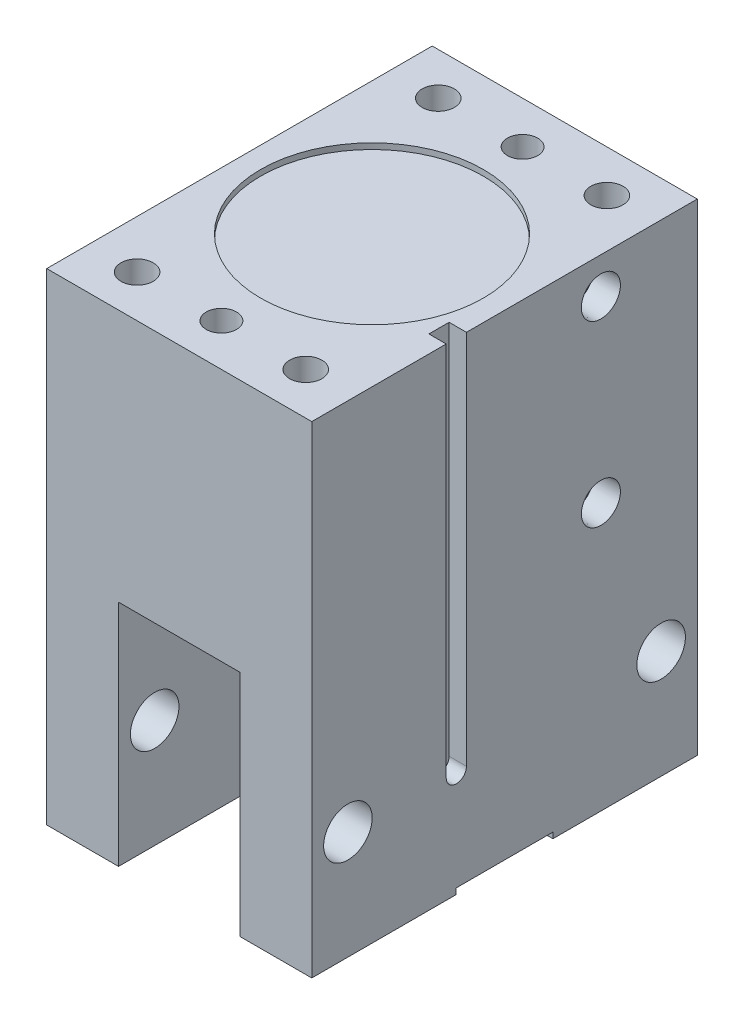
ISO-10303-21;
HEADER;
FILE_DESCRIPTION(('STEP AP214'),'2;1');
FILE_NAME('part.step','',(''),(''),'','','');
FILE_SCHEMA(('AUTOMOTIVE_DESIGN { 1 0 10303 214 1 1 1 1 }'));
ENDSEC;
DATA;
#1=APPLICATION_CONTEXT('core data for automotive mechanical design processes');
#2=APPLICATION_PROTOCOL_DEFINITION('international standard','automotive_design',2000,#1);
#3=PRODUCT_CONTEXT('',#1,'mechanical');
#4=PRODUCT('Part','Part','',(#3));
#5=PRODUCT_RELATED_PRODUCT_CATEGORY('part','',(#4));
#6=PRODUCT_DEFINITION_FORMATION('','',#4);
#7=PRODUCT_DEFINITION_CONTEXT('part definition',#1,'design');
#8=PRODUCT_DEFINITION('design','',#6,#7);
#9=PRODUCT_DEFINITION_SHAPE('','',#8);
#10=(LENGTH_UNIT() NAMED_UNIT(*) SI_UNIT(.MILLI.,.METRE.));
#11=(NAMED_UNIT(*) PLANE_ANGLE_UNIT() SI_UNIT($,.RADIAN.));
#12=(NAMED_UNIT(*) SI_UNIT($,.STERADIAN.) SOLID_ANGLE_UNIT());
#13=UNCERTAINTY_MEASURE_WITH_UNIT(LENGTH_MEASURE(1.E-05),#10,'distance_accuracy_value','');
#14=(GEOMETRIC_REPRESENTATION_CONTEXT(3) GLOBAL_UNCERTAINTY_ASSIGNED_CONTEXT((#13)) GLOBAL_UNIT_ASSIGNED_CONTEXT((#10,
#11,#12)) REPRESENTATION_CONTEXT('',''));
#15=CARTESIAN_POINT('',(0.,0.,0.));
#16=DIRECTION('',(0.,0.,1.));
#17=DIRECTION('',(1.,0.,0.));
#18=AXIS2_PLACEMENT_3D('',#15,#16,#17);
#19=CARTESIAN_POINT('',(-34.925,-63.5,50.8));
#20=DIRECTION('',(0.,1.,0.));
#21=DIRECTION('',(0.,0.,1.));
#22=AXIS2_PLACEMENT_3D('',#19,#20,#21);
#23=PLANE('',#22);
#24=DIRECTION('',(0.,0.,1.));
#25=VECTOR('',#24,1.);
#26=CARTESIAN_POINT('',(-34.925,-63.5,-50.8));
#27=LINE('',#26,#25);
#28=CARTESIAN_POINT('',(-34.925,-63.5,12.7635));
#29=VERTEX_POINT('',#28);
#30=CARTESIAN_POINT('',(-34.925,-63.5,50.8));
#31=VERTEX_POINT('',#30);
#32=EDGE_CURVE('E450',#29,#31,#27,.T.);
#33=ORIENTED_EDGE('',*,*,#32,.F.);
#34=DIRECTION('',(1.,0.,0.));
#35=VECTOR('',#34,1.);
#36=CARTESIAN_POINT('',(-34.925,-63.5,12.7635));
#37=LINE('',#36,#35);
#38=CARTESIAN_POINT('',(-16.002,-63.5,12.7635));
#39=VERTEX_POINT('',#38);
#40=EDGE_CURVE('E249',#29,#39,#37,.T.);
#41=ORIENTED_EDGE('',*,*,#40,.T.);
#42=DIRECTION('',(0.,0.,1.));
#43=VECTOR('',#42,1.);
#44=CARTESIAN_POINT('',(-16.002,-63.5,-50.8));
#45=LINE('',#44,#43);
#46=CARTESIAN_POINT('',(-16.002,-63.5,50.8));
#47=VERTEX_POINT('',#46);
#48=EDGE_CURVE('E270',#39,#47,#45,.T.);
#49=ORIENTED_EDGE('',*,*,#48,.T.);
#50=DIRECTION('',(1.,0.,0.));
#51=VECTOR('',#50,1.);
#52=CARTESIAN_POINT('',(-34.925,-63.5,50.8));
#53=LINE('',#52,#51);
#54=EDGE_CURVE('E468',#31,#47,#53,.T.);
#55=ORIENTED_EDGE('',*,*,#54,.F.);
#56=EDGE_LOOP('',(#33,#41,#49,#55));
#57=FACE_BOUND('',#56,.T.);
#58=ADVANCED_FACE('F37',(#57),#23,.F.);
#59=DIRECTION('',(0.,0.,1.));
#60=VECTOR('',#59,1.);
#61=CARTESIAN_POINT('',(16.002,-63.5,-50.8));
#62=LINE('',#61,#60);
#63=CARTESIAN_POINT('',(16.002,-63.5,12.7635));
#64=VERTEX_POINT('',#63);
#65=CARTESIAN_POINT('',(16.002,-63.5,50.8));
#66=VERTEX_POINT('',#65);
#67=EDGE_CURVE('E286',#64,#66,#62,.T.);
#68=ORIENTED_EDGE('',*,*,#67,.F.);
#69=CARTESIAN_POINT('',(34.925,-63.5,12.7635));
#70=VERTEX_POINT('',#69);
#71=EDGE_CURVE('E233',#64,#70,#37,.T.);
#72=ORIENTED_EDGE('',*,*,#71,.T.);
#73=DIRECTION('',(0.,0.,-1.));
#74=VECTOR('',#73,1.);
#75=CARTESIAN_POINT('',(34.925,-63.5,-50.8));
#76=LINE('',#75,#74);
#77=CARTESIAN_POINT('',(34.925,-63.5,50.8));
#78=VERTEX_POINT('',#77);
#79=EDGE_CURVE('E472',#78,#70,#76,.T.);
#80=ORIENTED_EDGE('',*,*,#79,.F.);
#81=EDGE_CURVE('E467',#66,#78,#53,.T.);
#82=ORIENTED_EDGE('',*,*,#81,.F.);
#83=EDGE_LOOP('',(#68,#72,#80,#82));
#84=FACE_BOUND('',#83,.T.);
#85=ADVANCED_FACE('F510',(#84),#23,.F.);
#86=CARTESIAN_POINT('',(-16.002,-63.5,-50.8));
#87=VERTEX_POINT('',#86);
#88=CARTESIAN_POINT('',(-16.002,-63.5,-12.7635));
#89=VERTEX_POINT('',#88);
#90=EDGE_CURVE('E287',#87,#89,#45,.T.);
#91=ORIENTED_EDGE('',*,*,#90,.T.);
#92=DIRECTION('',(1.,0.,0.));
#93=VECTOR('',#92,1.);
#94=CARTESIAN_POINT('',(-34.925,-63.5,-12.7635));
#95=LINE('',#94,#93);
#96=CARTESIAN_POINT('',(-34.925,-63.5,-12.7635));
#97=VERTEX_POINT('',#96);
#98=EDGE_CURVE('E52',#97,#89,#95,.T.);
#99=ORIENTED_EDGE('',*,*,#98,.F.);
#100=CARTESIAN_POINT('',(-34.925,-63.5,-50.8));
#101=VERTEX_POINT('',#100);
#102=EDGE_CURVE('E464',#101,#97,#27,.T.);
#103=ORIENTED_EDGE('',*,*,#102,.F.);
#104=DIRECTION('',(-1.,0.,0.));
#105=VECTOR('',#104,1.);
#106=CARTESIAN_POINT('',(-34.925,-63.5,-50.8));
#107=LINE('',#106,#105);
#108=EDGE_CURVE('E475',#87,#101,#107,.T.);
#109=ORIENTED_EDGE('',*,*,#108,.F.);
#110=EDGE_LOOP('',(#91,#99,#103,#109));
#111=FACE_BOUND('',#110,.T.);
#112=ADVANCED_FACE('F578',(#111),#23,.F.);
#113=CARTESIAN_POINT('',(-34.925,-34.925,-41.275));
#114=DIRECTION('',(1.,0.,0.));
#115=DIRECTION('',(0.,0.,-1.));
#116=AXIS2_PLACEMENT_3D('',#113,#114,#115);
#117=CYLINDRICAL_SURFACE('',#116,6.4);
#118=CARTESIAN_POINT('',(-16.002,-34.925,-41.275));
#119=DIRECTION('',(-1.,0.,0.));
#120=DIRECTION('',(0.,-1.,0.));
#121=AXIS2_PLACEMENT_3D('',#118,#119,#120);
#122=CIRCLE('',#121,6.4);
#123=CARTESIAN_POINT('',(-16.002,-41.325,-41.275));
#124=VERTEX_POINT('',#123);
#125=EDGE_CURVE('E294',#124,#124,#122,.F.);
#126=ORIENTED_EDGE('',*,*,#125,.T.);
#127=EDGE_LOOP('',(#126));
#128=FACE_BOUND('',#127,.T.);
#129=CARTESIAN_POINT('',(-34.925,-34.925,-41.275));
#130=DIRECTION('',(1.,0.,0.));
#131=DIRECTION('',(0.,0.,-1.));
#132=AXIS2_PLACEMENT_3D('',#129,#130,#131);
#133=CIRCLE('',#132,6.4);
#134=CARTESIAN_POINT('',(-34.925,-34.925,-47.675));
#135=VERTEX_POINT('',#134);
#136=EDGE_CURVE('E331',#135,#135,#133,.T.);
#137=ORIENTED_EDGE('',*,*,#136,.F.);
#138=EDGE_LOOP('',(#137));
#139=FACE_BOUND('',#138,.T.);
#140=ADVANCED_FACE('F592',(#128,#139),#117,.F.);
#141=CARTESIAN_POINT('',(-34.925,-34.925,41.275));
#142=DIRECTION('',(1.,0.,0.));
#143=DIRECTION('',(0.,0.,-1.));
#144=AXIS2_PLACEMENT_3D('',#141,#142,#143);
#145=CYLINDRICAL_SURFACE('',#144,6.4);
#146=CARTESIAN_POINT('',(-16.002,-34.925,41.275));
#147=DIRECTION('',(-1.,0.,0.));
#148=DIRECTION('',(0.,-1.,0.));
#149=AXIS2_PLACEMENT_3D('',#146,#147,#148);
#150=CIRCLE('',#149,6.4);
#151=CARTESIAN_POINT('',(-16.002,-41.325,41.275));
#152=VERTEX_POINT('',#151);
#153=EDGE_CURVE('E293',#152,#152,#150,.F.);
#154=ORIENTED_EDGE('',*,*,#153,.T.);
#155=EDGE_LOOP('',(#154));
#156=FACE_BOUND('',#155,.T.);
#157=CARTESIAN_POINT('',(-34.925,-34.925,41.275));
#158=DIRECTION('',(1.,0.,0.));
#159=DIRECTION('',(0.,0.,-1.));
#160=AXIS2_PLACEMENT_3D('',#157,#158,#159);
#161=CIRCLE('',#160,6.4);
#162=CARTESIAN_POINT('',(-34.925,-34.925,34.875));
#163=VERTEX_POINT('',#162);
#164=EDGE_CURVE('E325',#163,#163,#161,.T.);
#165=ORIENTED_EDGE('',*,*,#164,.F.);
#166=EDGE_LOOP('',(#165));
#167=FACE_BOUND('',#166,.T.);
#168=ADVANCED_FACE('F597',(#156,#167),#145,.F.);
#169=CARTESIAN_POINT('',(-34.925,63.5,-50.8));
#170=DIRECTION('',(1.,0.,0.));
#171=DIRECTION('',(0.,0.,-1.));
#172=AXIS2_PLACEMENT_3D('',#169,#170,#171);
#173=PLANE('',#172);
#174=ORIENTED_EDGE('',*,*,#164,.T.);
#175=EDGE_LOOP('',(#174));
#176=FACE_BOUND('',#175,.T.);
#177=ORIENTED_EDGE('',*,*,#136,.T.);
#178=EDGE_LOOP('',(#177));
#179=FACE_BOUND('',#178,.T.);
#180=CARTESIAN_POINT('',(-34.925,20.32,41.275));
#181=DIRECTION('',(-1.,0.,0.));
#182=DIRECTION('',(0.,0.,1.));
#183=AXIS2_PLACEMENT_3D('',#180,#181,#182);
#184=CIRCLE('',#183,4.);
#185=CARTESIAN_POINT('',(-34.925,20.32,45.275));
#186=VERTEX_POINT('',#185);
#187=EDGE_CURVE('E334',#186,#186,#184,.T.);
#188=ORIENTED_EDGE('',*,*,#187,.F.);
#189=EDGE_LOOP('',(#188));
#190=FACE_BOUND('',#189,.T.);
#191=CARTESIAN_POINT('',(-34.925,20.32,-41.275));
#192=DIRECTION('',(-1.,0.,0.));
#193=DIRECTION('',(0.,0.,1.));
#194=AXIS2_PLACEMENT_3D('',#191,#192,#193);
#195=CIRCLE('',#194,4.);
#196=CARTESIAN_POINT('',(-34.925,20.32,-37.275));
#197=VERTEX_POINT('',#196);
#198=EDGE_CURVE('E340',#197,#197,#195,.T.);
#199=ORIENTED_EDGE('',*,*,#198,.F.);
#200=EDGE_LOOP('',(#199));
#201=FACE_BOUND('',#200,.T.);
#202=CARTESIAN_POINT('',(-34.925,33.02,-41.275));
#203=DIRECTION('',(-1.,0.,0.));
#204=DIRECTION('',(0.,0.,1.));
#205=AXIS2_PLACEMENT_3D('',#202,#203,#204);
#206=CIRCLE('',#205,3.4);
#207=CARTESIAN_POINT('',(-34.925,33.02,-37.875));
#208=VERTEX_POINT('',#207);
#209=EDGE_CURVE('E351',#208,#208,#206,.T.);
#210=ORIENTED_EDGE('',*,*,#209,.F.);
#211=EDGE_LOOP('',(#210));
#212=FACE_BOUND('',#211,.T.);
#213=CARTESIAN_POINT('',(-34.925,33.02,41.275));
#214=DIRECTION('',(-1.,0.,0.));
#215=DIRECTION('',(0.,0.,1.));
#216=AXIS2_PLACEMENT_3D('',#213,#214,#215);
#217=CIRCLE('',#216,3.4);
#218=CARTESIAN_POINT('',(-34.925,33.02,44.675));
#219=VERTEX_POINT('',#218);
#220=EDGE_CURVE('E357',#219,#219,#217,.T.);
#221=ORIENTED_EDGE('',*,*,#220,.F.);
#222=EDGE_LOOP('',(#221));
#223=FACE_BOUND('',#222,.T.);
#224=CARTESIAN_POINT('',(-34.925,7.62000000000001,41.275));
#225=DIRECTION('',(-1.,0.,0.));
#226=DIRECTION('',(0.,0.,1.));
#227=AXIS2_PLACEMENT_3D('',#224,#225,#226);
#228=CIRCLE('',#227,3.4);
#229=CARTESIAN_POINT('',(-34.925,7.62000000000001,44.675));
#230=VERTEX_POINT('',#229);
#231=EDGE_CURVE('E363',#230,#230,#228,.T.);
#232=ORIENTED_EDGE('',*,*,#231,.F.);
#233=EDGE_LOOP('',(#232));
#234=FACE_BOUND('',#233,.T.);
#235=CARTESIAN_POINT('',(-34.925,7.62000000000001,-41.275));
#236=DIRECTION('',(-1.,0.,0.));
#237=DIRECTION('',(0.,0.,1.));
#238=AXIS2_PLACEMENT_3D('',#235,#236,#237);
#239=CIRCLE('',#238,3.4);
#240=CARTESIAN_POINT('',(-34.925,7.62000000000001,-37.875));
#241=VERTEX_POINT('',#240);
#242=EDGE_CURVE('E369',#241,#241,#239,.T.);
#243=ORIENTED_EDGE('',*,*,#242,.F.);
#244=EDGE_LOOP('',(#243));
#245=FACE_BOUND('',#244,.T.);
#246=DIRECTION('',(0.,0.,1.));
#247=VECTOR('',#246,1.);
#248=CARTESIAN_POINT('',(-34.925,-61.976,12.7635));
#249=LINE('',#248,#247);
#250=CARTESIAN_POINT('',(-34.925,-61.976,-12.7635));
#251=VERTEX_POINT('',#250);
#252=CARTESIAN_POINT('',(-34.925,-61.976,12.7635));
#253=VERTEX_POINT('',#252);
#254=EDGE_CURVE('E230',#251,#253,#249,.T.);
#255=ORIENTED_EDGE('',*,*,#254,.T.);
#256=DIRECTION('',(0.,-1.,0.));
#257=VECTOR('',#256,1.);
#258=CARTESIAN_POINT('',(-34.925,-63.5,12.7635));
#259=LINE('',#258,#257);
#260=EDGE_CURVE('E223',#253,#29,#259,.T.);
#261=ORIENTED_EDGE('',*,*,#260,.T.);
#262=ORIENTED_EDGE('',*,*,#32,.T.);
#263=DIRECTION('',(0.,-1.,0.));
#264=VECTOR('',#263,1.);
#265=CARTESIAN_POINT('',(-34.925,63.5,50.8));
#266=LINE('',#265,#264);
#267=CARTESIAN_POINT('',(-34.925,63.5,50.8));
#268=VERTEX_POINT('',#267);
#269=EDGE_CURVE('E486',#268,#31,#266,.T.);
#270=ORIENTED_EDGE('',*,*,#269,.F.);
#271=DIRECTION('',(0.,0.,1.));
#272=VECTOR('',#271,1.);
#273=CARTESIAN_POINT('',(-34.925,63.5,-50.8));
#274=LINE('',#273,#272);
#275=CARTESIAN_POINT('',(-34.925,63.5,-50.8));
#276=VERTEX_POINT('',#275);
#277=EDGE_CURVE('E451',#276,#268,#274,.T.);
#278=ORIENTED_EDGE('',*,*,#277,.F.);
#279=DIRECTION('',(0.,-1.,0.));
#280=VECTOR('',#279,1.);
#281=CARTESIAN_POINT('',(-34.925,63.5,-50.8));
#282=LINE('',#281,#280);
#283=EDGE_CURVE('E463',#276,#101,#282,.T.);
#284=ORIENTED_EDGE('',*,*,#283,.T.);
#285=ORIENTED_EDGE('',*,*,#102,.T.);
#286=DIRECTION('',(0.,1.,0.));
#287=VECTOR('',#286,1.);
#288=CARTESIAN_POINT('',(-34.925,-63.5,-12.7635));
#289=LINE('',#288,#287);
#290=EDGE_CURVE('E226',#97,#251,#289,.T.);
#291=ORIENTED_EDGE('',*,*,#290,.T.);
#292=EDGE_LOOP('',(#255,#261,#262,#270,#278,#284,#285,#291));
#293=FACE_BOUND('',#292,.T.);
#294=ADVANCED_FACE('F39',(#176,#179,#190,#201,#212,#223,#234,#245,#293),#173,.F.);
#295=CARTESIAN_POINT('',(-34.925,63.5,50.8));
#296=DIRECTION('',(0.,0.,-1.));
#297=DIRECTION('',(-1.,0.,0.));
#298=AXIS2_PLACEMENT_3D('',#295,#296,#297);
#299=PLANE('',#298);
#300=ORIENTED_EDGE('',*,*,#54,.T.);
#301=DIRECTION('',(0.,-1.,0.));
#302=VECTOR('',#301,1.);
#303=CARTESIAN_POINT('',(-16.002,-63.5,50.8));
#304=LINE('',#303,#302);
#305=CARTESIAN_POINT('',(-16.002,-3.175,50.8));
#306=VERTEX_POINT('',#305);
#307=EDGE_CURVE('E259',#306,#47,#304,.T.);
#308=ORIENTED_EDGE('',*,*,#307,.F.);
#309=DIRECTION('',(-1.,0.,0.));
#310=VECTOR('',#309,1.);
#311=CARTESIAN_POINT('',(-16.002,-3.175,50.8));
#312=LINE('',#311,#310);
#313=CARTESIAN_POINT('',(16.002,-3.175,50.8));
#314=VERTEX_POINT('',#313);
#315=EDGE_CURVE('E264',#314,#306,#312,.T.);
#316=ORIENTED_EDGE('',*,*,#315,.F.);
#317=DIRECTION('',(0.,1.,0.));
#318=VECTOR('',#317,1.);
#319=CARTESIAN_POINT('',(16.002,-63.5,50.8));
#320=LINE('',#319,#318);
#321=EDGE_CURVE('E273',#66,#314,#320,.T.);
#322=ORIENTED_EDGE('',*,*,#321,.F.);
#323=ORIENTED_EDGE('',*,*,#81,.T.);
#324=DIRECTION('',(0.,-1.,0.));
#325=VECTOR('',#324,1.);
#326=CARTESIAN_POINT('',(34.925,63.5,50.8));
#327=LINE('',#326,#325);
#328=CARTESIAN_POINT('',(34.925,63.5,50.8));
#329=VERTEX_POINT('',#328);
#330=EDGE_CURVE('E483',#329,#78,#327,.T.);
#331=ORIENTED_EDGE('',*,*,#330,.F.);
#332=DIRECTION('',(1.,0.,0.));
#333=VECTOR('',#332,1.);
#334=CARTESIAN_POINT('',(-34.925,63.5,50.8));
#335=LINE('',#334,#333);
#336=EDGE_CURVE('E454',#268,#329,#335,.T.);
#337=ORIENTED_EDGE('',*,*,#336,.F.);
#338=ORIENTED_EDGE('',*,*,#269,.T.);
#339=EDGE_LOOP('',(#300,#308,#316,#322,#323,#331,#337,#338));
#340=FACE_BOUND('',#339,.T.);
#341=ADVANCED_FACE('F518',(#340),#299,.F.);
#342=CARTESIAN_POINT('',(34.925,63.5,-50.8));
#343=DIRECTION('',(-1.,0.,0.));
#344=DIRECTION('',(0.,0.,1.));
#345=AXIS2_PLACEMENT_3D('',#342,#343,#344);
#346=PLANE('',#345);
#347=CARTESIAN_POINT('',(34.925,-34.925,41.275));
#348=DIRECTION('',(1.,0.,0.));
#349=DIRECTION('',(0.,0.,-1.));
#350=AXIS2_PLACEMENT_3D('',#347,#348,#349);
#351=CIRCLE('',#350,6.4);
#352=CARTESIAN_POINT('',(34.925,-34.925,34.875));
#353=VERTEX_POINT('',#352);
#354=EDGE_CURVE('E318',#353,#353,#351,.T.);
#355=ORIENTED_EDGE('',*,*,#354,.F.);
#356=EDGE_LOOP('',(#355));
#357=FACE_BOUND('',#356,.T.);
#358=CARTESIAN_POINT('',(34.925,-34.925,-41.275));
#359=DIRECTION('',(1.,0.,0.));
#360=DIRECTION('',(0.,0.,-1.));
#361=AXIS2_PLACEMENT_3D('',#358,#359,#360);
#362=CIRCLE('',#361,6.4);
#363=CARTESIAN_POINT('',(34.925,-34.925,-47.675));
#364=VERTEX_POINT('',#363);
#365=EDGE_CURVE('E328',#364,#364,#362,.T.);
#366=ORIENTED_EDGE('',*,*,#365,.F.);
#367=EDGE_LOOP('',(#366));
#368=FACE_BOUND('',#367,.T.);
#369=CARTESIAN_POINT('',(34.925,53.975,-25.4));
#370=DIRECTION('',(1.,0.,0.));
#371=DIRECTION('',(0.,0.,-1.));
#372=AXIS2_PLACEMENT_3D('',#369,#370,#371);
#373=CIRCLE('',#372,5.1435);
#374=CARTESIAN_POINT('',(34.925,53.975,-30.5435));
#375=VERTEX_POINT('',#374);
#376=EDGE_CURVE('E382',#375,#375,#373,.T.);
#377=ORIENTED_EDGE('',*,*,#376,.F.);
#378=EDGE_LOOP('',(#377));
#379=FACE_BOUND('',#378,.T.);
#380=CARTESIAN_POINT('',(34.925,6.858,-25.4));
#381=DIRECTION('',(1.,0.,0.));
#382=DIRECTION('',(0.,0.,-1.));
#383=AXIS2_PLACEMENT_3D('',#380,#381,#382);
#384=CIRCLE('',#383,5.1435);
#385=CARTESIAN_POINT('',(34.925,6.858,-30.5435));
#386=VERTEX_POINT('',#385);
#387=EDGE_CURVE('E396',#386,#386,#384,.T.);
#388=ORIENTED_EDGE('',*,*,#387,.F.);
#389=EDGE_LOOP('',(#388));
#390=FACE_BOUND('',#389,.T.);
#391=ORIENTED_EDGE('',*,*,#79,.T.);
#392=DIRECTION('',(0.,-1.,0.));
#393=VECTOR('',#392,1.);
#394=CARTESIAN_POINT('',(34.925,-63.5,12.7635));
#395=LINE('',#394,#393);
#396=CARTESIAN_POINT('',(34.925,-61.976,12.7635));
#397=VERTEX_POINT('',#396);
#398=EDGE_CURVE('E222',#397,#70,#395,.T.);
#399=ORIENTED_EDGE('',*,*,#398,.F.);
#400=DIRECTION('',(0.,0.,1.));
#401=VECTOR('',#400,1.);
#402=CARTESIAN_POINT('',(34.925,-61.976,12.7635));
#403=LINE('',#402,#401);
#404=CARTESIAN_POINT('',(34.925,-61.976,-12.7635));
#405=VERTEX_POINT('',#404);
#406=EDGE_CURVE('E227',#405,#397,#403,.T.);
#407=ORIENTED_EDGE('',*,*,#406,.F.);
#408=DIRECTION('',(0.,1.,0.));
#409=VECTOR('',#408,1.);
#410=CARTESIAN_POINT('',(34.925,-63.5,-12.7635));
#411=LINE('',#410,#409);
#412=CARTESIAN_POINT('',(34.925,-63.5,-12.7635));
#413=VERTEX_POINT('',#412);
#414=EDGE_CURVE('E235',#413,#405,#411,.T.);
#415=ORIENTED_EDGE('',*,*,#414,.F.);
#416=CARTESIAN_POINT('',(34.925,-63.5,-50.8));
#417=VERTEX_POINT('',#416);
#418=EDGE_CURVE('E471',#413,#417,#76,.T.);
#419=ORIENTED_EDGE('',*,*,#418,.T.);
#420=DIRECTION('',(0.,-1.,0.));
#421=VECTOR('',#420,1.);
#422=CARTESIAN_POINT('',(34.925,63.5,-50.8));
#423=LINE('',#422,#421);
#424=CARTESIAN_POINT('',(34.925,63.5,-50.8));
#425=VERTEX_POINT('',#424);
#426=EDGE_CURVE('E480',#425,#417,#423,.T.);
#427=ORIENTED_EDGE('',*,*,#426,.F.);
#428=DIRECTION('',(0.,0.,-1.));
#429=VECTOR('',#428,1.);
#430=CARTESIAN_POINT('',(34.925,63.5,-50.8));
#431=LINE('',#430,#429);
#432=CARTESIAN_POINT('',(34.925,63.5,10.033));
#433=VERTEX_POINT('',#432);
#434=EDGE_CURVE('E457',#433,#425,#431,.T.);
#435=ORIENTED_EDGE('',*,*,#434,.F.);
#436=DIRECTION('',(0.,1.,0.));
#437=VECTOR('',#436,1.);
#438=CARTESIAN_POINT('',(34.925,-35.56,10.033));
#439=LINE('',#438,#437);
#440=CARTESIAN_POINT('',(34.925,-35.56,10.033));
#441=VERTEX_POINT('',#440);
#442=EDGE_CURVE('E312',#441,#433,#439,.T.);
#443=ORIENTED_EDGE('',*,*,#442,.F.);
#444=CARTESIAN_POINT('',(34.925,-35.56,12.7));
#445=DIRECTION('',(1.,0.,0.));
#446=DIRECTION('',(0.,0.,-1.));
#447=AXIS2_PLACEMENT_3D('',#444,#445,#446);
#448=CIRCLE('',#447,2.667);
#449=CARTESIAN_POINT('',(34.925,-35.56,15.367));
#450=VERTEX_POINT('',#449);
#451=EDGE_CURVE('E297',#450,#441,#448,.T.);
#452=ORIENTED_EDGE('',*,*,#451,.F.);
#453=DIRECTION('',(0.,-1.,0.));
#454=VECTOR('',#453,1.);
#455=CARTESIAN_POINT('',(34.925,-35.56,15.367));
#456=LINE('',#455,#454);
#457=CARTESIAN_POINT('',(34.925,63.5,15.367));
#458=VERTEX_POINT('',#457);
#459=EDGE_CURVE('E302',#458,#450,#456,.T.);
#460=ORIENTED_EDGE('',*,*,#459,.F.);
#461=EDGE_CURVE('E458',#329,#458,#431,.T.);
#462=ORIENTED_EDGE('',*,*,#461,.F.);
#463=ORIENTED_EDGE('',*,*,#330,.T.);
#464=EDGE_LOOP('',(#391,#399,#407,#415,#419,#427,#435,#443,#452,#460,#462,#463));
#465=FACE_BOUND('',#464,.T.);
#466=ADVANCED_FACE('F513',(#357,#368,#379,#390,#465),#346,.F.);
#467=CARTESIAN_POINT('',(-34.925,63.5,-50.8));
#468=DIRECTION('',(0.,0.,1.));
#469=DIRECTION('',(1.,0.,0.));
#470=AXIS2_PLACEMENT_3D('',#467,#468,#469);
#471=PLANE('',#470);
#472=DIRECTION('',(-1.,0.,0.));
#473=VECTOR('',#472,1.);
#474=CARTESIAN_POINT('',(-16.002,-3.175,-50.8));
#475=LINE('',#474,#473);
#476=CARTESIAN_POINT('',(16.002,-3.175,-50.8));
#477=VERTEX_POINT('',#476);
#478=CARTESIAN_POINT('',(-16.002,-3.175,-50.8));
#479=VERTEX_POINT('',#478);
#480=EDGE_CURVE('E267',#477,#479,#475,.T.);
#481=ORIENTED_EDGE('',*,*,#480,.T.);
#482=DIRECTION('',(0.,-1.,0.));
#483=VECTOR('',#482,1.);
#484=CARTESIAN_POINT('',(-16.002,-63.5,-50.8));
#485=LINE('',#484,#483);
#486=EDGE_CURVE('E260',#479,#87,#485,.T.);
#487=ORIENTED_EDGE('',*,*,#486,.T.);
#488=ORIENTED_EDGE('',*,*,#108,.T.);
#489=ORIENTED_EDGE('',*,*,#283,.F.);
#490=DIRECTION('',(-1.,0.,0.));
#491=VECTOR('',#490,1.);
#492=CARTESIAN_POINT('',(-34.925,63.5,-50.8));
#493=LINE('',#492,#491);
#494=EDGE_CURVE('E461',#425,#276,#493,.T.);
#495=ORIENTED_EDGE('',*,*,#494,.F.);
#496=ORIENTED_EDGE('',*,*,#426,.T.);
#497=CARTESIAN_POINT('',(16.002,-63.5,-50.8));
#498=VERTEX_POINT('',#497);
#499=EDGE_CURVE('E455',#417,#498,#107,.T.);
#500=ORIENTED_EDGE('',*,*,#499,.T.);
#501=DIRECTION('',(0.,1.,0.));
#502=VECTOR('',#501,1.);
#503=CARTESIAN_POINT('',(16.002,-63.5,-50.8));
#504=LINE('',#503,#502);
#505=EDGE_CURVE('E263',#498,#477,#504,.T.);
#506=ORIENTED_EDGE('',*,*,#505,.T.);
#507=EDGE_LOOP('',(#481,#487,#488,#489,#495,#496,#500,#506));
#508=FACE_BOUND('',#507,.T.);
#509=ADVANCED_FACE('F528',(#508),#471,.F.);
#510=CARTESIAN_POINT('',(-34.925,63.5,50.8));
#511=DIRECTION('',(0.,1.,0.));
#512=DIRECTION('',(0.,0.,1.));
#513=AXIS2_PLACEMENT_3D('',#510,#511,#512);
#514=PLANE('',#513);
#515=DIRECTION('',(1.,0.,0.));
#516=VECTOR('',#515,1.);
#517=CARTESIAN_POINT('',(30.353,63.5,15.367));
#518=LINE('',#517,#516);
#519=CARTESIAN_POINT('',(30.353,63.5,15.367));
#520=VERTEX_POINT('',#519);
#521=EDGE_CURVE('E319',#520,#458,#518,.T.);
#522=ORIENTED_EDGE('',*,*,#521,.F.);
#523=DIRECTION('',(0.,0.,1.));
#524=VECTOR('',#523,1.);
#525=CARTESIAN_POINT('',(30.353,63.5,15.367));
#526=LINE('',#525,#524);
#527=CARTESIAN_POINT('',(30.353,63.5,10.033));
#528=VERTEX_POINT('',#527);
#529=EDGE_CURVE('E304',#528,#520,#526,.T.);
#530=ORIENTED_EDGE('',*,*,#529,.F.);
#531=DIRECTION('',(1.,0.,0.));
#532=VECTOR('',#531,1.);
#533=CARTESIAN_POINT('',(30.353,63.5,10.033));
#534=LINE('',#533,#532);
#535=EDGE_CURVE('E321',#528,#433,#534,.T.);
#536=ORIENTED_EDGE('',*,*,#535,.T.);
#537=ORIENTED_EDGE('',*,*,#434,.T.);
#538=ORIENTED_EDGE('',*,*,#494,.T.);
#539=ORIENTED_EDGE('',*,*,#277,.T.);
#540=ORIENTED_EDGE('',*,*,#336,.T.);
#541=ORIENTED_EDGE('',*,*,#461,.T.);
#542=EDGE_LOOP('',(#522,#530,#536,#537,#538,#539,#540,#541));
#543=FACE_BOUND('',#542,.T.);
#544=CARTESIAN_POINT('',(0.,63.5,0.));
#545=DIRECTION('',(0.,1.,0.));
#546=DIRECTION('',(0.,0.,1.));
#547=AXIS2_PLACEMENT_3D('',#544,#545,#546);
#548=CIRCLE('',#547,29.3624);
#549=CARTESIAN_POINT('',(0.,63.5,29.3624));
#550=VERTEX_POINT('',#549);
#551=EDGE_CURVE('E408',#550,#550,#548,.T.);
#552=ORIENTED_EDGE('',*,*,#551,.F.);
#553=EDGE_LOOP('',(#552));
#554=FACE_BOUND('',#553,.T.);
#555=CARTESIAN_POINT('',(0.,63.5,-39.6875));
#556=DIRECTION('',(0.,1.,0.));
#557=DIRECTION('',(0.,0.,1.));
#558=AXIS2_PLACEMENT_3D('',#555,#556,#557);
#559=CIRCLE('',#558,4.);
#560=CARTESIAN_POINT('',(0.,63.5,-35.6875));
#561=VERTEX_POINT('',#560);
#562=EDGE_CURVE('E412',#561,#561,#559,.T.);
#563=ORIENTED_EDGE('',*,*,#562,.F.);
#564=EDGE_LOOP('',(#563));
#565=FACE_BOUND('',#564,.T.);
#566=CARTESIAN_POINT('',(0.,63.5,39.6875));
#567=DIRECTION('',(0.,1.,0.));
#568=DIRECTION('',(0.,0.,1.));
#569=AXIS2_PLACEMENT_3D('',#566,#567,#568);
#570=CIRCLE('',#569,4.);
#571=CARTESIAN_POINT('',(0.,63.5,43.6875));
#572=VERTEX_POINT('',#571);
#573=EDGE_CURVE('E418',#572,#572,#570,.T.);
#574=ORIENTED_EDGE('',*,*,#573,.F.);
#575=EDGE_LOOP('',(#574));
#576=FACE_BOUND('',#575,.T.);
#577=CARTESIAN_POINT('',(22.225,63.5,-39.6875));
#578=DIRECTION('',(0.,1.,0.));
#579=DIRECTION('',(0.,0.,1.));
#580=AXIS2_PLACEMENT_3D('',#577,#578,#579);
#581=CIRCLE('',#580,4.25);
#582=CARTESIAN_POINT('',(22.225,63.5,-35.4375));
#583=VERTEX_POINT('',#582);
#584=EDGE_CURVE('E429',#583,#583,#581,.T.);
#585=ORIENTED_EDGE('',*,*,#584,.F.);
#586=EDGE_LOOP('',(#585));
#587=FACE_BOUND('',#586,.T.);
#588=CARTESIAN_POINT('',(22.225,63.5,39.6875));
#589=DIRECTION('',(0.,1.,0.));
#590=DIRECTION('',(0.,0.,1.));
#591=AXIS2_PLACEMENT_3D('',#588,#589,#590);
#592=CIRCLE('',#591,4.25);
#593=CARTESIAN_POINT('',(22.225,63.5,43.9375));
#594=VERTEX_POINT('',#593);
#595=EDGE_CURVE('E435',#594,#594,#592,.T.);
#596=ORIENTED_EDGE('',*,*,#595,.F.);
#597=EDGE_LOOP('',(#596));
#598=FACE_BOUND('',#597,.T.);
#599=CARTESIAN_POINT('',(-22.225,63.5,39.6875));
#600=DIRECTION('',(0.,1.,0.));
#601=DIRECTION('',(0.,0.,1.));
#602=AXIS2_PLACEMENT_3D('',#599,#600,#601);
#603=CIRCLE('',#602,4.25);
#604=CARTESIAN_POINT('',(-22.225,63.5,43.9375));
#605=VERTEX_POINT('',#604);
#606=EDGE_CURVE('E441',#605,#605,#603,.T.);
#607=ORIENTED_EDGE('',*,*,#606,.F.);
#608=EDGE_LOOP('',(#607));
#609=FACE_BOUND('',#608,.T.);
#610=CARTESIAN_POINT('',(-22.225,63.5,-39.6875));
#611=DIRECTION('',(0.,1.,0.));
#612=DIRECTION('',(0.,0.,1.));
#613=AXIS2_PLACEMENT_3D('',#610,#611,#612);
#614=CIRCLE('',#613,4.25);
#615=CARTESIAN_POINT('',(-22.225,63.5,-35.4375));
#616=VERTEX_POINT('',#615);
#617=EDGE_CURVE('E447',#616,#616,#614,.T.);
#618=ORIENTED_EDGE('',*,*,#617,.F.);
#619=EDGE_LOOP('',(#618));
#620=FACE_BOUND('',#619,.T.);
#621=ADVANCED_FACE('F544',(#543,#554,#565,#576,#587,#598,#609,#620),#514,.T.);
#622=ORIENTED_EDGE('',*,*,#418,.F.);
#623=CARTESIAN_POINT('',(16.002,-63.5,-12.7635));
#624=VERTEX_POINT('',#623);
#625=EDGE_CURVE('E248',#624,#413,#95,.T.);
#626=ORIENTED_EDGE('',*,*,#625,.F.);
#627=EDGE_CURVE('E283',#498,#624,#62,.T.);
#628=ORIENTED_EDGE('',*,*,#627,.F.);
#629=ORIENTED_EDGE('',*,*,#499,.F.);
#630=EDGE_LOOP('',(#622,#626,#628,#629));
#631=FACE_BOUND('',#630,.T.);
#632=ADVANCED_FACE('F534',(#631),#23,.F.);
#633=CARTESIAN_POINT('',(-22.225,63.5,-39.6875));
#634=DIRECTION('',(0.,1.,0.));
#635=DIRECTION('',(0.,0.,1.));
#636=AXIS2_PLACEMENT_3D('',#633,#634,#635);
#637=CYLINDRICAL_SURFACE('',#636,4.24999999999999);
#638=CARTESIAN_POINT('',(-22.225,43.5,-39.6875));
#639=DIRECTION('',(0.,1.,0.));
#640=DIRECTION('',(0.,0.,1.));
#641=AXIS2_PLACEMENT_3D('',#638,#639,#640);
#642=CIRCLE('',#641,4.24999999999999);
#643=CARTESIAN_POINT('',(-22.225,43.5,-35.4375));
#644=VERTEX_POINT('',#643);
#645=EDGE_CURVE('E444',#644,#644,#642,.T.);
#646=ORIENTED_EDGE('',*,*,#645,.F.);
#647=EDGE_LOOP('',(#646));
#648=FACE_BOUND('',#647,.T.);
#649=ORIENTED_EDGE('',*,*,#617,.T.);
#650=EDGE_LOOP('',(#649));
#651=FACE_BOUND('',#650,.T.);
#652=ADVANCED_FACE('F583',(#648,#651),#637,.F.);
#653=CARTESIAN_POINT('',(-22.225,43.5,-39.6875));
#654=DIRECTION('',(0.,1.,0.));
#655=DIRECTION('',(0.,0.,1.));
#656=AXIS2_PLACEMENT_3D('',#653,#654,#655);
#657=CONICAL_SURFACE('',#656,4.24999999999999,1.02974425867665);
#658=CARTESIAN_POINT('',(-22.225,40.9463423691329,-39.6875));
#659=VERTEX_POINT('',#658);
#660=VERTEX_LOOP('',#659);
#661=FACE_BOUND('',#660,.T.);
#662=ORIENTED_EDGE('',*,*,#645,.T.);
#663=EDGE_LOOP('',(#662));
#664=FACE_BOUND('',#663,.T.);
#665=ADVANCED_FACE('F588',(#661,#664),#657,.F.);
#666=CARTESIAN_POINT('',(-22.225,63.5,39.6875));
#667=DIRECTION('',(0.,1.,0.));
#668=DIRECTION('',(0.,0.,1.));
#669=AXIS2_PLACEMENT_3D('',#666,#667,#668);
#670=CYLINDRICAL_SURFACE('',#669,4.24999999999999);
#671=CARTESIAN_POINT('',(-22.225,43.5,39.6875));
#672=DIRECTION('',(0.,1.,0.));
#673=DIRECTION('',(0.,0.,1.));
#674=AXIS2_PLACEMENT_3D('',#671,#672,#673);
#675=CIRCLE('',#674,4.24999999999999);
#676=CARTESIAN_POINT('',(-22.225,43.5,43.9375));
#677=VERTEX_POINT('',#676);
#678=EDGE_CURVE('E438',#677,#677,#675,.T.);
#679=ORIENTED_EDGE('',*,*,#678,.F.);
#680=EDGE_LOOP('',(#679));
#681=FACE_BOUND('',#680,.T.);
#682=ORIENTED_EDGE('',*,*,#606,.T.);
#683=EDGE_LOOP('',(#682));
#684=FACE_BOUND('',#683,.T.);
#685=ADVANCED_FACE('F780',(#681,#684),#670,.F.);
#686=CARTESIAN_POINT('',(-22.225,43.5,39.6875));
#687=DIRECTION('',(0.,1.,0.));
#688=DIRECTION('',(0.,0.,1.));
#689=AXIS2_PLACEMENT_3D('',#686,#687,#688);
#690=CONICAL_SURFACE('',#689,4.24999999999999,1.02974425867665);
#691=CARTESIAN_POINT('',(-22.225,40.9463423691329,39.6875));
#692=VERTEX_POINT('',#691);
#693=VERTEX_LOOP('',#692);
#694=FACE_BOUND('',#693,.T.);
#695=ORIENTED_EDGE('',*,*,#678,.T.);
#696=EDGE_LOOP('',(#695));
#697=FACE_BOUND('',#696,.T.);
#698=ADVANCED_FACE('F772',(#694,#697),#690,.F.);
#699=CARTESIAN_POINT('',(22.225,63.5,39.6875));
#700=DIRECTION('',(0.,1.,0.));
#701=DIRECTION('',(0.,0.,1.));
#702=AXIS2_PLACEMENT_3D('',#699,#700,#701);
#703=CYLINDRICAL_SURFACE('',#702,4.24999999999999);
#704=CARTESIAN_POINT('',(22.225,43.5,39.6875));
#705=DIRECTION('',(0.,1.,0.));
#706=DIRECTION('',(0.,0.,1.));
#707=AXIS2_PLACEMENT_3D('',#704,#705,#706);
#708=CIRCLE('',#707,4.24999999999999);
#709=CARTESIAN_POINT('',(22.225,43.5,43.9375));
#710=VERTEX_POINT('',#709);
#711=EDGE_CURVE('E432',#710,#710,#708,.T.);
#712=ORIENTED_EDGE('',*,*,#711,.F.);
#713=EDGE_LOOP('',(#712));
#714=FACE_BOUND('',#713,.T.);
#715=ORIENTED_EDGE('',*,*,#595,.T.);
#716=EDGE_LOOP('',(#715));
#717=FACE_BOUND('',#716,.T.);
#718=ADVANCED_FACE('F768',(#714,#717),#703,.F.);
#719=CARTESIAN_POINT('',(22.225,43.5,39.6875));
#720=DIRECTION('',(0.,1.,0.));
#721=DIRECTION('',(0.,0.,1.));
#722=AXIS2_PLACEMENT_3D('',#719,#720,#721);
#723=CONICAL_SURFACE('',#722,4.24999999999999,1.02974425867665);
#724=CARTESIAN_POINT('',(22.225,40.9463423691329,39.6875));
#725=VERTEX_POINT('',#724);
#726=VERTEX_LOOP('',#725);
#727=FACE_BOUND('',#726,.T.);
#728=ORIENTED_EDGE('',*,*,#711,.T.);
#729=EDGE_LOOP('',(#728));
#730=FACE_BOUND('',#729,.T.);
#731=ADVANCED_FACE('F759',(#727,#730),#723,.F.);
#732=CARTESIAN_POINT('',(22.225,63.5,-39.6875));
#733=DIRECTION('',(0.,1.,0.));
#734=DIRECTION('',(0.,0.,1.));
#735=AXIS2_PLACEMENT_3D('',#732,#733,#734);
#736=CYLINDRICAL_SURFACE('',#735,4.24999999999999);
#737=CARTESIAN_POINT('',(22.225,43.5,-39.6875));
#738=DIRECTION('',(0.,1.,0.));
#739=DIRECTION('',(0.,0.,1.));
#740=AXIS2_PLACEMENT_3D('',#737,#738,#739);
#741=CIRCLE('',#740,4.24999999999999);
#742=CARTESIAN_POINT('',(22.225,43.5,-35.4375));
#743=VERTEX_POINT('',#742);
#744=EDGE_CURVE('E424',#743,#743,#741,.T.);
#745=ORIENTED_EDGE('',*,*,#744,.F.);
#746=EDGE_LOOP('',(#745));
#747=FACE_BOUND('',#746,.T.);
#748=ORIENTED_EDGE('',*,*,#584,.T.);
#749=EDGE_LOOP('',(#748));
#750=FACE_BOUND('',#749,.T.);
#751=ADVANCED_FACE('F753',(#747,#750),#736,.F.);
#752=CARTESIAN_POINT('',(22.225,43.5,-39.6875));
#753=DIRECTION('',(0.,1.,0.));
#754=DIRECTION('',(0.,0.,1.));
#755=AXIS2_PLACEMENT_3D('',#752,#753,#754);
#756=CONICAL_SURFACE('',#755,4.24999999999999,1.02974425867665);
#757=CARTESIAN_POINT('',(22.225,40.9463423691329,-39.6875));
#758=VERTEX_POINT('',#757);
#759=VERTEX_LOOP('',#758);
#760=FACE_BOUND('',#759,.T.);
#761=ORIENTED_EDGE('',*,*,#744,.T.);
#762=EDGE_LOOP('',(#761));
#763=FACE_BOUND('',#762,.T.);
#764=ADVANCED_FACE('F758',(#760,#763),#756,.F.);
#765=CARTESIAN_POINT('',(0.,53.5,39.6875));
#766=DIRECTION('',(0.,1.,0.));
#767=DIRECTION('',(0.,0.,1.));
#768=AXIS2_PLACEMENT_3D('',#765,#766,#767);
#769=CYLINDRICAL_SURFACE('',#768,4.);
#770=CARTESIAN_POINT('',(0.,53.5,39.6875));
#771=DIRECTION('',(0.,1.,0.));
#772=DIRECTION('',(0.,0.,1.));
#773=AXIS2_PLACEMENT_3D('',#770,#771,#772);
#774=CIRCLE('',#773,4.);
#775=CARTESIAN_POINT('',(0.,53.5,43.6875));
#776=VERTEX_POINT('',#775);
#777=EDGE_CURVE('E421',#776,#776,#774,.T.);
#778=ORIENTED_EDGE('',*,*,#777,.F.);
#779=EDGE_LOOP('',(#778));
#780=FACE_BOUND('',#779,.T.);
#781=ORIENTED_EDGE('',*,*,#573,.T.);
#782=EDGE_LOOP('',(#781));
#783=FACE_BOUND('',#782,.T.);
#784=ADVANCED_FACE('F836',(#780,#783),#769,.F.);
#785=CARTESIAN_POINT('',(0.,53.5,39.6875));
#786=DIRECTION('',(0.,1.,0.));
#787=DIRECTION('',(0.,0.,1.));
#788=AXIS2_PLACEMENT_3D('',#785,#786,#787);
#789=PLANE('',#788);
#790=ORIENTED_EDGE('',*,*,#777,.T.);
#791=EDGE_LOOP('',(#790));
#792=FACE_BOUND('',#791,.T.);
#793=ADVANCED_FACE('F846',(#792),#789,.T.);
#794=CARTESIAN_POINT('',(0.,53.5,-39.6875));
#795=DIRECTION('',(0.,1.,0.));
#796=DIRECTION('',(0.,0.,1.));
#797=AXIS2_PLACEMENT_3D('',#794,#795,#796);
#798=CYLINDRICAL_SURFACE('',#797,4.);
#799=CARTESIAN_POINT('',(0.,53.5,-39.6875));
#800=DIRECTION('',(0.,1.,0.));
#801=DIRECTION('',(0.,0.,1.));
#802=AXIS2_PLACEMENT_3D('',#799,#800,#801);
#803=CIRCLE('',#802,4.);
#804=CARTESIAN_POINT('',(0.,53.5,-35.6875));
#805=VERTEX_POINT('',#804);
#806=EDGE_CURVE('E415',#805,#805,#803,.T.);
#807=ORIENTED_EDGE('',*,*,#806,.F.);
#808=EDGE_LOOP('',(#807));
#809=FACE_BOUND('',#808,.T.);
#810=ORIENTED_EDGE('',*,*,#562,.T.);
#811=EDGE_LOOP('',(#810));
#812=FACE_BOUND('',#811,.T.);
#813=ADVANCED_FACE('F856',(#809,#812),#798,.F.);
#814=CARTESIAN_POINT('',(0.,53.5,-39.6875));
#815=DIRECTION('',(0.,1.,0.));
#816=DIRECTION('',(0.,0.,1.));
#817=AXIS2_PLACEMENT_3D('',#814,#815,#816);
#818=PLANE('',#817);
#819=ORIENTED_EDGE('',*,*,#806,.T.);
#820=EDGE_LOOP('',(#819));
#821=FACE_BOUND('',#820,.T.);
#822=ADVANCED_FACE('F866',(#821),#818,.T.);
#823=CARTESIAN_POINT('',(0.,61.976,0.));
#824=DIRECTION('',(0.,1.,0.));
#825=DIRECTION('',(0.,0.,1.));
#826=AXIS2_PLACEMENT_3D('',#823,#824,#825);
#827=CYLINDRICAL_SURFACE('',#826,29.3624);
#828=CARTESIAN_POINT('',(0.,61.976,0.));
#829=DIRECTION('',(0.,1.,0.));
#830=DIRECTION('',(0.,0.,1.));
#831=AXIS2_PLACEMENT_3D('',#828,#829,#830);
#832=CIRCLE('',#831,29.3624);
#833=CARTESIAN_POINT('',(0.,61.976,29.3624));
#834=VERTEX_POINT('',#833);
#835=EDGE_CURVE('E409',#834,#834,#832,.T.);
#836=CARTESIAN_POINT('',(0.,61.976,29.3624));
#837=CARTESIAN_POINT('',(0.,61.991875,29.3624));
#838=CARTESIAN_POINT('',(0.,62.00775,29.3624));
#839=CARTESIAN_POINT('',(0.,62.0395,29.3624));
#840=CARTESIAN_POINT('',(0.,62.055375,29.3624));
#841=CARTESIAN_POINT('',(0.,62.087125,29.3624));
#842=CARTESIAN_POINT('',(0.,62.103,29.3624));
#843=CARTESIAN_POINT('',(0.,62.13475,29.3624));
#844=CARTESIAN_POINT('',(0.,62.150625,29.3624));
#845=CARTESIAN_POINT('',(0.,62.182375,29.3624));
#846=CARTESIAN_POINT('',(0.,62.19825,29.3624));
#847=CARTESIAN_POINT('',(0.,62.23,29.3624));
#848=CARTESIAN_POINT('',(0.,62.245875,29.3624));
#849=CARTESIAN_POINT('',(0.,62.277625,29.3624));
#850=CARTESIAN_POINT('',(0.,62.2935,29.3624));
#851=CARTESIAN_POINT('',(0.,62.32525,29.3624));
#852=CARTESIAN_POINT('',(0.,62.341125,29.3624));
#853=CARTESIAN_POINT('',(0.,62.372875,29.3624));
#854=CARTESIAN_POINT('',(0.,62.38875,29.3624));
#855=CARTESIAN_POINT('',(0.,62.4205,29.3624));
#856=CARTESIAN_POINT('',(0.,62.436375,29.3624));
#857=CARTESIAN_POINT('',(0.,62.468125,29.3624));
#858=CARTESIAN_POINT('',(0.,62.484,29.3624));
#859=CARTESIAN_POINT('',(0.,62.51575,29.3624));
#860=CARTESIAN_POINT('',(0.,62.531625,29.3624));
#861=CARTESIAN_POINT('',(0.,62.563375,29.3624));
#862=CARTESIAN_POINT('',(0.,62.57925,29.3624));
#863=CARTESIAN_POINT('',(0.,62.611,29.3624));
#864=CARTESIAN_POINT('',(0.,62.626875,29.3624));
#865=CARTESIAN_POINT('',(0.,62.658625,29.3624));
#866=CARTESIAN_POINT('',(0.,62.6745,29.3624));
#867=CARTESIAN_POINT('',(0.,62.70625,29.3624));
#868=CARTESIAN_POINT('',(0.,62.722125,29.3624));
#869=CARTESIAN_POINT('',(0.,62.753875,29.3624));
#870=CARTESIAN_POINT('',(0.,62.76975,29.3624));
#871=CARTESIAN_POINT('',(0.,62.8015,29.3624));
#872=CARTESIAN_POINT('',(0.,62.817375,29.3624));
#873=CARTESIAN_POINT('',(0.,62.849125,29.3624));
#874=CARTESIAN_POINT('',(0.,62.865,29.3624));
#875=CARTESIAN_POINT('',(0.,62.89675,29.3624));
#876=CARTESIAN_POINT('',(0.,62.912625,29.3624));
#877=CARTESIAN_POINT('',(0.,62.944375,29.3624));
#878=CARTESIAN_POINT('',(0.,62.96025,29.3624));
#879=CARTESIAN_POINT('',(0.,62.992,29.3624));
#880=CARTESIAN_POINT('',(0.,63.007875,29.3624));
#881=CARTESIAN_POINT('',(0.,63.039625,29.3624));
#882=CARTESIAN_POINT('',(0.,63.0555,29.3624));
#883=CARTESIAN_POINT('',(0.,63.08725,29.3624));
#884=CARTESIAN_POINT('',(0.,63.103125,29.3624));
#885=CARTESIAN_POINT('',(0.,63.134875,29.3624));
#886=CARTESIAN_POINT('',(0.,63.15075,29.3624));
#887=CARTESIAN_POINT('',(0.,63.1825,29.3624));
#888=CARTESIAN_POINT('',(0.,63.198375,29.3624));
#889=CARTESIAN_POINT('',(0.,63.230125,29.3624));
#890=CARTESIAN_POINT('',(0.,63.246,29.3624));
#891=CARTESIAN_POINT('',(0.,63.27775,29.3624));
#892=CARTESIAN_POINT('',(0.,63.293625,29.3624));
#893=CARTESIAN_POINT('',(0.,63.325375,29.3624));
#894=CARTESIAN_POINT('',(0.,63.34125,29.3624));
#895=CARTESIAN_POINT('',(0.,63.373,29.3624));
#896=CARTESIAN_POINT('',(0.,63.388875,29.3624));
#897=CARTESIAN_POINT('',(0.,63.420625,29.3624));
#898=CARTESIAN_POINT('',(0.,63.4365,29.3624));
#899=CARTESIAN_POINT('',(0.,63.46825,29.3624));
#900=CARTESIAN_POINT('',(0.,63.484125,29.3624));
#901=CARTESIAN_POINT('',(0.,63.5,29.3624));
#902=B_SPLINE_CURVE_WITH_KNOTS('',3,(#836,#837,#838,#839,#840,#841,#842,#843,#844,#845,#846,
#847,#848,#849,#850,#851,#852,#853,#854,#855,#856,#857,#858,#859,#860,#861,#862,#863,#864,#865,
#866,#867,#868,#869,#870,#871,#872,#873,#874,#875,#876,#877,#878,#879,#880,#881,#882,#883,#884,
#885,#886,#887,#888,#889,#890,#891,#892,#893,#894,#895,#896,#897,#898,#899,#900,#901),
.UNSPECIFIED.,.F.,.F.,(4,2,2,2,2,2,2,2,2,2,2,2,2,2,2,2,2,2,2,2,2,2,2,2,2,2,2,2,2,2,2,2,4),(0.,
0.0476250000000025,0.0952500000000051,0.142875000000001,0.190500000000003,0.238125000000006,
0.285750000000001,0.333375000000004,0.380999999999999,0.428625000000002,0.476250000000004,
0.523875,0.571499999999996,0.619125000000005,0.666750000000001,0.714374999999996,
0.762000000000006,0.809625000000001,0.857249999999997,0.904875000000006,0.952500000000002,
1.000125,1.04774999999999,1.095375,1.143,1.19062499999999,1.23825,1.285875,1.33349999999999,
1.381125,1.42875,1.476375,1.52399999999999),.UNSPECIFIED.);
#903=EDGE_CURVE('BSEAM876',#834,#550,#902,.T.);
#904=ORIENTED_EDGE('',*,*,#835,.F.);
#905=ORIENTED_EDGE('',*,*,#551,.T.);
#906=ORIENTED_EDGE('',*,*,#903,.T.);
#907=ORIENTED_EDGE('',*,*,#903,.F.);
#908=EDGE_LOOP('',(#904,#906,#905,#907));
#909=FACE_BOUND('',#908,.T.);
#910=ADVANCED_FACE('F876',(#909),#827,.F.);
#911=CARTESIAN_POINT('',(0.,61.976,0.));
#912=DIRECTION('',(0.,1.,0.));
#913=DIRECTION('',(0.,0.,1.));
#914=AXIS2_PLACEMENT_3D('',#911,#912,#913);
#915=PLANE('',#914);
#916=ORIENTED_EDGE('',*,*,#835,.T.);
#917=EDGE_LOOP('',(#916));
#918=FACE_BOUND('',#917,.T.);
#919=ADVANCED_FACE('F886',(#918),#915,.T.);
#920=CARTESIAN_POINT('',(22.225,11.057999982,-25.4));
#921=DIRECTION('',(-1.,0.,0.));
#922=DIRECTION('',(0.,0.,1.));
#923=AXIS2_PLACEMENT_3D('',#920,#921,#922);
#924=PLANE('',#923);
#925=CARTESIAN_POINT('',(22.225,6.858,-25.4));
#926=DIRECTION('',(1.,0.,0.));
#927=DIRECTION('',(0.,0.,-1.));
#928=AXIS2_PLACEMENT_3D('',#925,#926,#927);
#929=CIRCLE('',#928,0.8001);
#930=CARTESIAN_POINT('',(22.225,6.858,-26.2001));
#931=VERTEX_POINT('',#930);
#932=EDGE_CURVE('E372',#931,#931,#929,.T.);
#933=ORIENTED_EDGE('',*,*,#932,.F.);
#934=EDGE_LOOP('',(#933));
#935=FACE_BOUND('',#934,.T.);
#936=CARTESIAN_POINT('',(22.225,6.858,-25.4));
#937=DIRECTION('',(1.,0.,0.));
#938=DIRECTION('',(0.,0.,-1.));
#939=AXIS2_PLACEMENT_3D('',#936,#937,#938);
#940=CIRCLE('',#939,4.199999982);
#941=CARTESIAN_POINT('',(22.225,6.858,-29.599999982));
#942=VERTEX_POINT('',#941);
#943=EDGE_CURVE('E405',#942,#942,#940,.T.);
#944=ORIENTED_EDGE('',*,*,#943,.T.);
#945=EDGE_LOOP('',(#944));
#946=FACE_BOUND('',#945,.T.);
#947=ADVANCED_FACE('F896',(#935,#946),#924,.F.);
#948=CARTESIAN_POINT('',(34.925,6.858,-25.4));
#949=DIRECTION('',(1.,0.,0.));
#950=DIRECTION('',(0.,0.,-1.));
#951=AXIS2_PLACEMENT_3D('',#948,#949,#950);
#952=CYLINDRICAL_SURFACE('',#951,4.199999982);
#953=ORIENTED_EDGE('',*,*,#943,.F.);
#954=EDGE_LOOP('',(#953));
#955=FACE_BOUND('',#954,.T.);
#956=CARTESIAN_POINT('',(28.00101,6.858,-25.4));
#957=DIRECTION('',(1.,0.,0.));
#958=DIRECTION('',(0.,0.,-1.));
#959=AXIS2_PLACEMENT_3D('',#956,#957,#958);
#960=CIRCLE('',#959,4.199999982);
#961=CARTESIAN_POINT('',(28.00101,6.858,-29.599999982));
#962=VERTEX_POINT('',#961);
#963=EDGE_CURVE('E402',#962,#962,#960,.T.);
#964=ORIENTED_EDGE('',*,*,#963,.T.);
#965=EDGE_LOOP('',(#964));
#966=FACE_BOUND('',#965,.T.);
#967=ADVANCED_FACE('F904',(#955,#966),#952,.F.);
#968=CARTESIAN_POINT('',(28.00101,11.057999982,-25.4));
#969=DIRECTION('',(-1.,0.,0.));
#970=DIRECTION('',(0.,0.,1.));
#971=AXIS2_PLACEMENT_3D('',#968,#969,#970);
#972=PLANE('',#971);
#973=ORIENTED_EDGE('',*,*,#963,.F.);
#974=EDGE_LOOP('',(#973));
#975=FACE_BOUND('',#974,.T.);
#976=CARTESIAN_POINT('',(28.00101,6.858,-25.4));
#977=DIRECTION('',(1.,0.,0.));
#978=DIRECTION('',(0.,0.,-1.));
#979=AXIS2_PLACEMENT_3D('',#976,#977,#978);
#980=CIRCLE('',#979,4.93618646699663);
#981=CARTESIAN_POINT('',(28.00101,6.858,-30.3361864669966));
#982=VERTEX_POINT('',#981);
#983=EDGE_CURVE('E399',#982,#982,#980,.T.);
#984=ORIENTED_EDGE('',*,*,#983,.T.);
#985=EDGE_LOOP('',(#984));
#986=FACE_BOUND('',#985,.T.);
#987=ADVANCED_FACE('F909',(#975,#986),#972,.F.);
#988=CARTESIAN_POINT('',(34.925,6.858,-25.4));
#989=DIRECTION('',(1.,0.,0.));
#990=DIRECTION('',(0.,0.,-1.));
#991=AXIS2_PLACEMENT_3D('',#988,#989,#990);
#992=CONICAL_SURFACE('',#991,5.1435,0.029932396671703);
#993=ORIENTED_EDGE('',*,*,#983,.F.);
#994=EDGE_LOOP('',(#993));
#995=FACE_BOUND('',#994,.T.);
#996=ORIENTED_EDGE('',*,*,#387,.T.);
#997=EDGE_LOOP('',(#996));
#998=FACE_BOUND('',#997,.T.);
#999=ADVANCED_FACE('F919',(#995,#998),#992,.F.);
#1000=CARTESIAN_POINT('',(22.225,58.174999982,-25.4));
#1001=DIRECTION('',(-1.,0.,0.));
#1002=DIRECTION('',(0.,0.,1.));
#1003=AXIS2_PLACEMENT_3D('',#1000,#1001,#1002);
#1004=PLANE('',#1003);
#1005=CARTESIAN_POINT('',(22.225,53.975,-25.4));
#1006=DIRECTION('',(1.,0.,0.));
#1007=DIRECTION('',(0.,0.,-1.));
#1008=AXIS2_PLACEMENT_3D('',#1005,#1006,#1007);
#1009=CIRCLE('',#1008,0.8001);
#1010=CARTESIAN_POINT('',(22.225,53.975,-26.2001));
#1011=VERTEX_POINT('',#1010);
#1012=EDGE_CURVE('E376',#1011,#1011,#1009,.T.);
#1013=ORIENTED_EDGE('',*,*,#1012,.F.);
#1014=EDGE_LOOP('',(#1013));
#1015=FACE_BOUND('',#1014,.T.);
#1016=CARTESIAN_POINT('',(22.225,53.975,-25.4));
#1017=DIRECTION('',(1.,0.,0.));
#1018=DIRECTION('',(0.,0.,-1.));
#1019=AXIS2_PLACEMENT_3D('',#1016,#1017,#1018);
#1020=CIRCLE('',#1019,4.199999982);
#1021=CARTESIAN_POINT('',(22.225,53.975,-29.599999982));
#1022=VERTEX_POINT('',#1021);
#1023=EDGE_CURVE('E393',#1022,#1022,#1020,.T.);
#1024=ORIENTED_EDGE('',*,*,#1023,.T.);
#1025=EDGE_LOOP('',(#1024));
#1026=FACE_BOUND('',#1025,.T.);
#1027=ADVANCED_FACE('F929',(#1015,#1026),#1004,.F.);
#1028=CARTESIAN_POINT('',(34.925,53.975,-25.4));
#1029=DIRECTION('',(1.,0.,0.));
#1030=DIRECTION('',(0.,0.,-1.));
#1031=AXIS2_PLACEMENT_3D('',#1028,#1029,#1030);
#1032=CYLINDRICAL_SURFACE('',#1031,4.199999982);
#1033=ORIENTED_EDGE('',*,*,#1023,.F.);
#1034=EDGE_LOOP('',(#1033));
#1035=FACE_BOUND('',#1034,.T.);
#1036=CARTESIAN_POINT('',(28.00101,53.975,-25.4));
#1037=DIRECTION('',(1.,0.,0.));
#1038=DIRECTION('',(0.,0.,-1.));
#1039=AXIS2_PLACEMENT_3D('',#1036,#1037,#1038);
#1040=CIRCLE('',#1039,4.199999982);
#1041=CARTESIAN_POINT('',(28.00101,53.975,-29.599999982));
#1042=VERTEX_POINT('',#1041);
#1043=EDGE_CURVE('E390',#1042,#1042,#1040,.T.);
#1044=ORIENTED_EDGE('',*,*,#1043,.T.);
#1045=EDGE_LOOP('',(#1044));
#1046=FACE_BOUND('',#1045,.T.);
#1047=ADVANCED_FACE('F937',(#1035,#1046),#1032,.F.);
#1048=CARTESIAN_POINT('',(28.00101,58.174999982,-25.4));
#1049=DIRECTION('',(-1.,0.,0.));
#1050=DIRECTION('',(0.,0.,1.));
#1051=AXIS2_PLACEMENT_3D('',#1048,#1049,#1050);
#1052=PLANE('',#1051);
#1053=ORIENTED_EDGE('',*,*,#1043,.F.);
#1054=EDGE_LOOP('',(#1053));
#1055=FACE_BOUND('',#1054,.T.);
#1056=CARTESIAN_POINT('',(28.00101,53.975,-25.4));
#1057=DIRECTION('',(1.,0.,0.));
#1058=DIRECTION('',(0.,0.,-1.));
#1059=AXIS2_PLACEMENT_3D('',#1056,#1057,#1058);
#1060=CIRCLE('',#1059,4.93618646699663);
#1061=CARTESIAN_POINT('',(28.00101,53.975,-30.3361864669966));
#1062=VERTEX_POINT('',#1061);
#1063=EDGE_CURVE('E387',#1062,#1062,#1060,.T.);
#1064=ORIENTED_EDGE('',*,*,#1063,.T.);
#1065=EDGE_LOOP('',(#1064));
#1066=FACE_BOUND('',#1065,.T.);
#1067=ADVANCED_FACE('F942',(#1055,#1066),#1052,.F.);
#1068=CARTESIAN_POINT('',(34.925,53.975,-25.4));
#1069=DIRECTION('',(1.,0.,0.));
#1070=DIRECTION('',(0.,0.,-1.));
#1071=AXIS2_PLACEMENT_3D('',#1068,#1069,#1070);
#1072=CONICAL_SURFACE('',#1071,5.1435,0.0299323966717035);
#1073=ORIENTED_EDGE('',*,*,#1063,.F.);
#1074=EDGE_LOOP('',(#1073));
#1075=FACE_BOUND('',#1074,.T.);
#1076=ORIENTED_EDGE('',*,*,#376,.T.);
#1077=EDGE_LOOP('',(#1076));
#1078=FACE_BOUND('',#1077,.T.);
#1079=ADVANCED_FACE('F952',(#1075,#1078),#1072,.F.);
#1080=CARTESIAN_POINT('',(15.875,53.975,-25.4));
#1081=DIRECTION('',(1.,0.,0.));
#1082=DIRECTION('',(0.,0.,-1.));
#1083=AXIS2_PLACEMENT_3D('',#1080,#1081,#1082);
#1084=CYLINDRICAL_SURFACE('',#1083,0.8001);
#1085=CARTESIAN_POINT('',(15.875,53.975,-25.4));
#1086=DIRECTION('',(1.,0.,0.));
#1087=DIRECTION('',(0.,0.,-1.));
#1088=AXIS2_PLACEMENT_3D('',#1085,#1086,#1087);
#1089=CIRCLE('',#1088,0.8001);
#1090=CARTESIAN_POINT('',(15.875,53.975,-26.2001));
#1091=VERTEX_POINT('',#1090);
#1092=EDGE_CURVE('E379',#1091,#1091,#1089,.T.);
#1093=ORIENTED_EDGE('',*,*,#1092,.F.);
#1094=EDGE_LOOP('',(#1093));
#1095=FACE_BOUND('',#1094,.T.);
#1096=ORIENTED_EDGE('',*,*,#1012,.T.);
#1097=EDGE_LOOP('',(#1096));
#1098=FACE_BOUND('',#1097,.T.);
#1099=ADVANCED_FACE('F962',(#1095,#1098),#1084,.F.);
#1100=CARTESIAN_POINT('',(15.875,53.975,-25.4));
#1101=DIRECTION('',(1.,0.,0.));
#1102=DIRECTION('',(0.,0.,-1.));
#1103=AXIS2_PLACEMENT_3D('',#1100,#1101,#1102);
#1104=PLANE('',#1103);
#1105=ORIENTED_EDGE('',*,*,#1092,.T.);
#1106=EDGE_LOOP('',(#1105));
#1107=FACE_BOUND('',#1106,.T.);
#1108=ADVANCED_FACE('F986',(#1107),#1104,.T.);
#1109=CARTESIAN_POINT('',(15.875,6.858,-25.4));
#1110=DIRECTION('',(1.,0.,0.));
#1111=DIRECTION('',(0.,0.,-1.));
#1112=AXIS2_PLACEMENT_3D('',#1109,#1110,#1111);
#1113=CYLINDRICAL_SURFACE('',#1112,0.8001);
#1114=CARTESIAN_POINT('',(15.875,6.858,-25.4));
#1115=DIRECTION('',(1.,0.,0.));
#1116=DIRECTION('',(0.,0.,-1.));
#1117=AXIS2_PLACEMENT_3D('',#1114,#1115,#1116);
#1118=CIRCLE('',#1117,0.8001);
#1119=CARTESIAN_POINT('',(15.875,6.858,-26.2001));
#1120=VERTEX_POINT('',#1119);
#1121=EDGE_CURVE('E373',#1120,#1120,#1118,.T.);
#1122=ORIENTED_EDGE('',*,*,#1121,.F.);
#1123=EDGE_LOOP('',(#1122));
#1124=FACE_BOUND('',#1123,.T.);
#1125=ORIENTED_EDGE('',*,*,#932,.T.);
#1126=EDGE_LOOP('',(#1125));
#1127=FACE_BOUND('',#1126,.T.);
#1128=ADVANCED_FACE('F996',(#1124,#1127),#1113,.F.);
#1129=CARTESIAN_POINT('',(15.875,6.858,-25.4));
#1130=DIRECTION('',(1.,0.,0.));
#1131=DIRECTION('',(0.,0.,-1.));
#1132=AXIS2_PLACEMENT_3D('',#1129,#1130,#1131);
#1133=PLANE('',#1132);
#1134=ORIENTED_EDGE('',*,*,#1121,.T.);
#1135=EDGE_LOOP('',(#1134));
#1136=FACE_BOUND('',#1135,.T.);
#1137=ADVANCED_FACE('F746',(#1136),#1133,.T.);
#1138=CARTESIAN_POINT('',(-34.925,7.62000000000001,-41.275));
#1139=DIRECTION('',(-1.,0.,0.));
#1140=DIRECTION('',(0.,0.,1.));
#1141=AXIS2_PLACEMENT_3D('',#1138,#1139,#1140);
#1142=CYLINDRICAL_SURFACE('',#1141,3.4);
#1143=CARTESIAN_POINT('',(-18.925,7.62000000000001,-41.275));
#1144=DIRECTION('',(-1.,0.,0.));
#1145=DIRECTION('',(0.,0.,1.));
#1146=AXIS2_PLACEMENT_3D('',#1143,#1144,#1145);
#1147=CIRCLE('',#1146,3.4);
#1148=CARTESIAN_POINT('',(-18.925,7.62000000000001,-37.875));
#1149=VERTEX_POINT('',#1148);
#1150=EDGE_CURVE('E366',#1149,#1149,#1147,.T.);
#1151=ORIENTED_EDGE('',*,*,#1150,.F.);
#1152=EDGE_LOOP('',(#1151));
#1153=FACE_BOUND('',#1152,.T.);
#1154=ORIENTED_EDGE('',*,*,#242,.T.);
#1155=EDGE_LOOP('',(#1154));
#1156=FACE_BOUND('',#1155,.T.);
#1157=ADVANCED_FACE('F742',(#1153,#1156),#1142,.F.);
#1158=CARTESIAN_POINT('',(-18.925,7.62000000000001,-41.275));
#1159=DIRECTION('',(-1.,0.,0.));
#1160=DIRECTION('',(0.,0.,1.));
#1161=AXIS2_PLACEMENT_3D('',#1158,#1159,#1160);
#1162=CONICAL_SURFACE('',#1161,3.4,1.02974425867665);
#1163=CARTESIAN_POINT('',(-16.8820738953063,7.62,-41.275));
#1164=VERTEX_POINT('',#1163);
#1165=VERTEX_LOOP('',#1164);
#1166=FACE_BOUND('',#1165,.T.);
#1167=ORIENTED_EDGE('',*,*,#1150,.T.);
#1168=EDGE_LOOP('',(#1167));
#1169=FACE_BOUND('',#1168,.T.);
#1170=ADVANCED_FACE('F735',(#1166,#1169),#1162,.F.);
#1171=CARTESIAN_POINT('',(-34.925,7.62000000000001,41.275));
#1172=DIRECTION('',(-1.,0.,0.));
#1173=DIRECTION('',(0.,0.,1.));
#1174=AXIS2_PLACEMENT_3D('',#1171,#1172,#1173);
#1175=CYLINDRICAL_SURFACE('',#1174,3.4);
#1176=CARTESIAN_POINT('',(-18.925,7.62000000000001,41.275));
#1177=DIRECTION('',(-1.,0.,0.));
#1178=DIRECTION('',(0.,0.,1.));
#1179=AXIS2_PLACEMENT_3D('',#1176,#1177,#1178);
#1180=CIRCLE('',#1179,3.4);
#1181=CARTESIAN_POINT('',(-18.925,7.62000000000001,44.675));
#1182=VERTEX_POINT('',#1181);
#1183=EDGE_CURVE('E360',#1182,#1182,#1180,.T.);
#1184=ORIENTED_EDGE('',*,*,#1183,.F.);
#1185=EDGE_LOOP('',(#1184));
#1186=FACE_BOUND('',#1185,.T.);
#1187=ORIENTED_EDGE('',*,*,#231,.T.);
#1188=EDGE_LOOP('',(#1187));
#1189=FACE_BOUND('',#1188,.T.);
#1190=ADVANCED_FACE('F731',(#1186,#1189),#1175,.F.);
#1191=CARTESIAN_POINT('',(-18.925,7.62000000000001,41.275));
#1192=DIRECTION('',(-1.,0.,0.));
#1193=DIRECTION('',(0.,0.,1.));
#1194=AXIS2_PLACEMENT_3D('',#1191,#1192,#1193);
#1195=CONICAL_SURFACE('',#1194,3.4,1.02974425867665);
#1196=CARTESIAN_POINT('',(-16.8820738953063,7.62,41.275));
#1197=VERTEX_POINT('',#1196);
#1198=VERTEX_LOOP('',#1197);
#1199=FACE_BOUND('',#1198,.T.);
#1200=ORIENTED_EDGE('',*,*,#1183,.T.);
#1201=EDGE_LOOP('',(#1200));
#1202=FACE_BOUND('',#1201,.T.);
#1203=ADVANCED_FACE('F723',(#1199,#1202),#1195,.F.);
#1204=CARTESIAN_POINT('',(-34.925,33.02,41.275));
#1205=DIRECTION('',(-1.,0.,0.));
#1206=DIRECTION('',(0.,0.,1.));
#1207=AXIS2_PLACEMENT_3D('',#1204,#1205,#1206);
#1208=CYLINDRICAL_SURFACE('',#1207,3.4);
#1209=CARTESIAN_POINT('',(-18.925,33.02,41.275));
#1210=DIRECTION('',(-1.,0.,0.));
#1211=DIRECTION('',(0.,0.,1.));
#1212=AXIS2_PLACEMENT_3D('',#1209,#1210,#1211);
#1213=CIRCLE('',#1212,3.39999999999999);
#1214=CARTESIAN_POINT('',(-18.925,33.02,44.675));
#1215=VERTEX_POINT('',#1214);
#1216=EDGE_CURVE('E354',#1215,#1215,#1213,.T.);
#1217=ORIENTED_EDGE('',*,*,#1216,.F.);
#1218=EDGE_LOOP('',(#1217));
#1219=FACE_BOUND('',#1218,.T.);
#1220=ORIENTED_EDGE('',*,*,#220,.T.);
#1221=EDGE_LOOP('',(#1220));
#1222=FACE_BOUND('',#1221,.T.);
#1223=ADVANCED_FACE('F719',(#1219,#1222),#1208,.F.);
#1224=CARTESIAN_POINT('',(-18.925,33.02,41.275));
#1225=DIRECTION('',(-1.,0.,0.));
#1226=DIRECTION('',(0.,0.,1.));
#1227=AXIS2_PLACEMENT_3D('',#1224,#1225,#1226);
#1228=CONICAL_SURFACE('',#1227,3.39999999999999,1.02974425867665);
#1229=CARTESIAN_POINT('',(-16.8820738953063,33.02,41.275));
#1230=VERTEX_POINT('',#1229);
#1231=VERTEX_LOOP('',#1230);
#1232=FACE_BOUND('',#1231,.T.);
#1233=ORIENTED_EDGE('',*,*,#1216,.T.);
#1234=EDGE_LOOP('',(#1233));
#1235=FACE_BOUND('',#1234,.T.);
#1236=ADVANCED_FACE('F709',(#1232,#1235),#1228,.F.);
#1237=CARTESIAN_POINT('',(-34.925,33.02,-41.275));
#1238=DIRECTION('',(-1.,0.,0.));
#1239=DIRECTION('',(0.,0.,1.));
#1240=AXIS2_PLACEMENT_3D('',#1237,#1238,#1239);
#1241=CYLINDRICAL_SURFACE('',#1240,3.4);
#1242=CARTESIAN_POINT('',(-18.925,33.02,-41.275));
#1243=DIRECTION('',(-1.,0.,0.));
#1244=DIRECTION('',(0.,0.,1.));
#1245=AXIS2_PLACEMENT_3D('',#1242,#1243,#1244);
#1246=CIRCLE('',#1245,3.39999999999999);
#1247=CARTESIAN_POINT('',(-18.925,33.02,-37.875));
#1248=VERTEX_POINT('',#1247);
#1249=EDGE_CURVE('E346',#1248,#1248,#1246,.T.);
#1250=ORIENTED_EDGE('',*,*,#1249,.F.);
#1251=EDGE_LOOP('',(#1250));
#1252=FACE_BOUND('',#1251,.T.);
#1253=ORIENTED_EDGE('',*,*,#209,.T.);
#1254=EDGE_LOOP('',(#1253));
#1255=FACE_BOUND('',#1254,.T.);
#1256=ADVANCED_FACE('F703',(#1252,#1255),#1241,.F.);
#1257=CARTESIAN_POINT('',(-18.925,33.02,-41.275));
#1258=DIRECTION('',(-1.,0.,0.));
#1259=DIRECTION('',(0.,0.,1.));
#1260=AXIS2_PLACEMENT_3D('',#1257,#1258,#1259);
#1261=CONICAL_SURFACE('',#1260,3.39999999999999,1.02974425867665);
#1262=CARTESIAN_POINT('',(-16.8820738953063,33.02,-41.275));
#1263=VERTEX_POINT('',#1262);
#1264=VERTEX_LOOP('',#1263);
#1265=FACE_BOUND('',#1264,.T.);
#1266=ORIENTED_EDGE('',*,*,#1249,.T.);
#1267=EDGE_LOOP('',(#1266));
#1268=FACE_BOUND('',#1267,.T.);
#1269=ADVANCED_FACE('F708',(#1265,#1268),#1261,.F.);
#1270=CARTESIAN_POINT('',(-28.925,20.32,-41.275));
#1271=DIRECTION('',(-1.,0.,0.));
#1272=DIRECTION('',(0.,0.,1.));
#1273=AXIS2_PLACEMENT_3D('',#1270,#1271,#1272);
#1274=CYLINDRICAL_SURFACE('',#1273,4.);
#1275=CARTESIAN_POINT('',(-28.925,20.32,-41.275));
#1276=DIRECTION('',(-1.,0.,0.));
#1277=DIRECTION('',(0.,0.,1.));
#1278=AXIS2_PLACEMENT_3D('',#1275,#1276,#1277);
#1279=CIRCLE('',#1278,4.);
#1280=CARTESIAN_POINT('',(-28.925,20.32,-37.275));
#1281=VERTEX_POINT('',#1280);
#1282=EDGE_CURVE('E343',#1281,#1281,#1279,.T.);
#1283=ORIENTED_EDGE('',*,*,#1282,.F.);
#1284=EDGE_LOOP('',(#1283));
#1285=FACE_BOUND('',#1284,.T.);
#1286=ORIENTED_EDGE('',*,*,#198,.T.);
#1287=EDGE_LOOP('',(#1286));
#1288=FACE_BOUND('',#1287,.T.);
#1289=ADVANCED_FACE('F1062',(#1285,#1288),#1274,.F.);
#1290=CARTESIAN_POINT('',(-28.925,20.32,-41.275));
#1291=DIRECTION('',(-1.,0.,0.));
#1292=DIRECTION('',(0.,0.,1.));
#1293=AXIS2_PLACEMENT_3D('',#1290,#1291,#1292);
#1294=PLANE('',#1293);
#1295=ORIENTED_EDGE('',*,*,#1282,.T.);
#1296=EDGE_LOOP('',(#1295));
#1297=FACE_BOUND('',#1296,.T.);
#1298=ADVANCED_FACE('F1072',(#1297),#1294,.T.);
#1299=CARTESIAN_POINT('',(-28.925,20.32,41.275));
#1300=DIRECTION('',(-1.,0.,0.));
#1301=DIRECTION('',(0.,0.,1.));
#1302=AXIS2_PLACEMENT_3D('',#1299,#1300,#1301);
#1303=CYLINDRICAL_SURFACE('',#1302,4.);
#1304=CARTESIAN_POINT('',(-28.925,20.32,41.275));
#1305=DIRECTION('',(-1.,0.,0.));
#1306=DIRECTION('',(0.,0.,1.));
#1307=AXIS2_PLACEMENT_3D('',#1304,#1305,#1306);
#1308=CIRCLE('',#1307,4.);
#1309=CARTESIAN_POINT('',(-28.925,20.32,45.275));
#1310=VERTEX_POINT('',#1309);
#1311=EDGE_CURVE('E337',#1310,#1310,#1308,.T.);
#1312=ORIENTED_EDGE('',*,*,#1311,.F.);
#1313=EDGE_LOOP('',(#1312));
#1314=FACE_BOUND('',#1313,.T.);
#1315=ORIENTED_EDGE('',*,*,#187,.T.);
#1316=EDGE_LOOP('',(#1315));
#1317=FACE_BOUND('',#1316,.T.);
#1318=ADVANCED_FACE('F1082',(#1314,#1317),#1303,.F.);
#1319=CARTESIAN_POINT('',(-28.925,20.32,41.275));
#1320=DIRECTION('',(-1.,0.,0.));
#1321=DIRECTION('',(0.,0.,1.));
#1322=AXIS2_PLACEMENT_3D('',#1319,#1320,#1321);
#1323=PLANE('',#1322);
#1324=ORIENTED_EDGE('',*,*,#1311,.T.);
#1325=EDGE_LOOP('',(#1324));
#1326=FACE_BOUND('',#1325,.T.);
#1327=ADVANCED_FACE('F1092',(#1326),#1323,.T.);
#1328=CARTESIAN_POINT('',(16.002,-34.925,-41.275));
#1329=DIRECTION('',(1.,0.,0.));
#1330=DIRECTION('',(0.,1.,0.));
#1331=AXIS2_PLACEMENT_3D('',#1328,#1329,#1330);
#1332=CIRCLE('',#1331,6.4);
#1333=CARTESIAN_POINT('',(16.002,-28.525,-41.275));
#1334=VERTEX_POINT('',#1333);
#1335=EDGE_CURVE('E290',#1334,#1334,#1332,.F.);
#1336=ORIENTED_EDGE('',*,*,#1335,.T.);
#1337=EDGE_LOOP('',(#1336));
#1338=FACE_BOUND('',#1337,.T.);
#1339=ORIENTED_EDGE('',*,*,#365,.T.);
#1340=EDGE_LOOP('',(#1339));
#1341=FACE_BOUND('',#1340,.T.);
#1342=ADVANCED_FACE('F600',(#1338,#1341),#117,.F.);
#1343=CARTESIAN_POINT('',(16.002,-34.925,41.275));
#1344=DIRECTION('',(1.,0.,0.));
#1345=DIRECTION('',(0.,1.,0.));
#1346=AXIS2_PLACEMENT_3D('',#1343,#1344,#1345);
#1347=CIRCLE('',#1346,6.4);
#1348=CARTESIAN_POINT('',(16.002,-28.525,41.275));
#1349=VERTEX_POINT('',#1348);
#1350=EDGE_CURVE('E280',#1349,#1349,#1347,.F.);
#1351=ORIENTED_EDGE('',*,*,#1350,.T.);
#1352=EDGE_LOOP('',(#1351));
#1353=FACE_BOUND('',#1352,.T.);
#1354=ORIENTED_EDGE('',*,*,#354,.T.);
#1355=EDGE_LOOP('',(#1354));
#1356=FACE_BOUND('',#1355,.T.);
#1357=ADVANCED_FACE('F1122',(#1353,#1356),#145,.F.);
#1358=CARTESIAN_POINT('',(30.353,-35.56,12.7));
#1359=DIRECTION('',(1.,0.,0.));
#1360=DIRECTION('',(0.,0.,-1.));
#1361=AXIS2_PLACEMENT_3D('',#1358,#1359,#1360);
#1362=CYLINDRICAL_SURFACE('',#1361,2.667);
#1363=ORIENTED_EDGE('',*,*,#451,.T.);
#1364=DIRECTION('',(1.,0.,0.));
#1365=VECTOR('',#1364,1.);
#1366=CARTESIAN_POINT('',(30.353,-35.56,10.033));
#1367=LINE('',#1366,#1365);
#1368=CARTESIAN_POINT('',(30.353,-35.56,10.033));
#1369=VERTEX_POINT('',#1368);
#1370=EDGE_CURVE('E309',#1369,#441,#1367,.T.);
#1371=ORIENTED_EDGE('',*,*,#1370,.F.);
#1372=CARTESIAN_POINT('',(30.353,-35.56,12.7));
#1373=DIRECTION('',(1.,0.,0.));
#1374=DIRECTION('',(0.,0.,-1.));
#1375=AXIS2_PLACEMENT_3D('',#1372,#1373,#1374);
#1376=CIRCLE('',#1375,2.667);
#1377=CARTESIAN_POINT('',(30.353,-35.56,15.367));
#1378=VERTEX_POINT('',#1377);
#1379=EDGE_CURVE('E298',#1378,#1369,#1376,.T.);
#1380=ORIENTED_EDGE('',*,*,#1379,.F.);
#1381=DIRECTION('',(1.,0.,0.));
#1382=VECTOR('',#1381,1.);
#1383=CARTESIAN_POINT('',(30.353,-35.56,15.367));
#1384=LINE('',#1383,#1382);
#1385=EDGE_CURVE('E316',#1378,#450,#1384,.T.);
#1386=ORIENTED_EDGE('',*,*,#1385,.T.);
#1387=EDGE_LOOP('',(#1363,#1371,#1380,#1386));
#1388=FACE_BOUND('',#1387,.T.);
#1389=ADVANCED_FACE('F554',(#1388),#1362,.F.);
#1390=CARTESIAN_POINT('',(30.353,-35.56,15.367));
#1391=DIRECTION('',(0.,0.,1.));
#1392=DIRECTION('',(1.,0.,0.));
#1393=AXIS2_PLACEMENT_3D('',#1390,#1391,#1392);
#1394=PLANE('',#1393);
#1395=ORIENTED_EDGE('',*,*,#459,.T.);
#1396=ORIENTED_EDGE('',*,*,#1385,.F.);
#1397=DIRECTION('',(0.,-1.,0.));
#1398=VECTOR('',#1397,1.);
#1399=CARTESIAN_POINT('',(30.353,-35.56,15.367));
#1400=LINE('',#1399,#1398);
#1401=EDGE_CURVE('E306',#520,#1378,#1400,.T.);
#1402=ORIENTED_EDGE('',*,*,#1401,.F.);
#1403=ORIENTED_EDGE('',*,*,#521,.T.);
#1404=EDGE_LOOP('',(#1395,#1396,#1402,#1403));
#1405=FACE_BOUND('',#1404,.T.);
#1406=ADVANCED_FACE('F558',(#1405),#1394,.F.);
#1407=CARTESIAN_POINT('',(30.353,-35.56,10.033));
#1408=DIRECTION('',(0.,0.,-1.));
#1409=DIRECTION('',(-1.,0.,0.));
#1410=AXIS2_PLACEMENT_3D('',#1407,#1408,#1409);
#1411=PLANE('',#1410);
#1412=ORIENTED_EDGE('',*,*,#442,.T.);
#1413=ORIENTED_EDGE('',*,*,#535,.F.);
#1414=DIRECTION('',(0.,1.,0.));
#1415=VECTOR('',#1414,1.);
#1416=CARTESIAN_POINT('',(30.353,-35.56,10.033));
#1417=LINE('',#1416,#1415);
#1418=EDGE_CURVE('E301',#1369,#528,#1417,.T.);
#1419=ORIENTED_EDGE('',*,*,#1418,.F.);
#1420=ORIENTED_EDGE('',*,*,#1370,.T.);
#1421=EDGE_LOOP('',(#1412,#1413,#1419,#1420));
#1422=FACE_BOUND('',#1421,.T.);
#1423=ADVANCED_FACE('F551',(#1422),#1411,.F.);
#1424=CARTESIAN_POINT('',(30.353,-35.56,12.7));
#1425=DIRECTION('',(1.,0.,0.));
#1426=DIRECTION('',(0.,0.,-1.));
#1427=AXIS2_PLACEMENT_3D('',#1424,#1425,#1426);
#1428=PLANE('',#1427);
#1429=ORIENTED_EDGE('',*,*,#1379,.T.);
#1430=ORIENTED_EDGE('',*,*,#1418,.T.);
#1431=ORIENTED_EDGE('',*,*,#529,.T.);
#1432=ORIENTED_EDGE('',*,*,#1401,.T.);
#1433=EDGE_LOOP('',(#1429,#1430,#1431,#1432));
#1434=FACE_BOUND('',#1433,.T.);
#1435=ADVANCED_FACE('F560',(#1434),#1428,.T.);
#1436=CARTESIAN_POINT('',(-16.002,-63.5,-50.8));
#1437=DIRECTION('',(-1.,0.,0.));
#1438=DIRECTION('',(0.,-1.,0.));
#1439=AXIS2_PLACEMENT_3D('',#1436,#1437,#1438);
#1440=PLANE('',#1439);
#1441=ORIENTED_EDGE('',*,*,#153,.F.);
#1442=EDGE_LOOP('',(#1441));
#1443=FACE_BOUND('',#1442,.T.);
#1444=ORIENTED_EDGE('',*,*,#48,.F.);
#1445=DIRECTION('',(0.,1.,0.));
#1446=VECTOR('',#1445,1.);
#1447=CARTESIAN_POINT('',(-16.002,-63.5,12.7635));
#1448=LINE('',#1447,#1446);
#1449=CARTESIAN_POINT('',(-16.002,-61.976,12.7635));
#1450=VERTEX_POINT('',#1449);
#1451=EDGE_CURVE('E256',#39,#1450,#1448,.T.);
#1452=ORIENTED_EDGE('',*,*,#1451,.T.);
#1453=DIRECTION('',(0.,0.,-1.));
#1454=VECTOR('',#1453,1.);
#1455=CARTESIAN_POINT('',(-16.002,-61.976,-50.8));
#1456=LINE('',#1455,#1454);
#1457=CARTESIAN_POINT('',(-16.002,-61.976,-12.7635));
#1458=VERTEX_POINT('',#1457);
#1459=EDGE_CURVE('E253',#1450,#1458,#1456,.T.);
#1460=ORIENTED_EDGE('',*,*,#1459,.T.);
#1461=DIRECTION('',(0.,-1.,0.));
#1462=VECTOR('',#1461,1.);
#1463=CARTESIAN_POINT('',(-16.002,-63.5,-12.7635));
#1464=LINE('',#1463,#1462);
#1465=EDGE_CURVE('E242',#1458,#89,#1464,.T.);
#1466=ORIENTED_EDGE('',*,*,#1465,.T.);
#1467=ORIENTED_EDGE('',*,*,#90,.F.);
#1468=ORIENTED_EDGE('',*,*,#486,.F.);
#1469=DIRECTION('',(0.,0.,1.));
#1470=VECTOR('',#1469,1.);
#1471=CARTESIAN_POINT('',(-16.002,-3.175,-50.8));
#1472=LINE('',#1471,#1470);
#1473=EDGE_CURVE('E278',#479,#306,#1472,.T.);
#1474=ORIENTED_EDGE('',*,*,#1473,.T.);
#1475=ORIENTED_EDGE('',*,*,#307,.T.);
#1476=EDGE_LOOP('',(#1444,#1452,#1460,#1466,#1467,#1468,#1474,#1475));
#1477=FACE_BOUND('',#1476,.T.);
#1478=ORIENTED_EDGE('',*,*,#125,.F.);
#1479=EDGE_LOOP('',(#1478));
#1480=FACE_BOUND('',#1479,.T.);
#1481=ADVANCED_FACE('F562',(#1443,#1477,#1480),#1440,.F.);
#1482=CARTESIAN_POINT('',(16.002,-63.5,-50.8));
#1483=DIRECTION('',(1.,0.,0.));
#1484=DIRECTION('',(0.,1.,0.));
#1485=AXIS2_PLACEMENT_3D('',#1482,#1483,#1484);
#1486=PLANE('',#1485);
#1487=ORIENTED_EDGE('',*,*,#1350,.F.);
#1488=EDGE_LOOP('',(#1487));
#1489=FACE_BOUND('',#1488,.T.);
#1490=DIRECTION('',(0.,0.,1.));
#1491=VECTOR('',#1490,1.);
#1492=CARTESIAN_POINT('',(16.002,-61.976,-50.8));
#1493=LINE('',#1492,#1491);
#1494=CARTESIAN_POINT('',(16.002,-61.976,-12.7635));
#1495=VERTEX_POINT('',#1494);
#1496=CARTESIAN_POINT('',(16.002,-61.976,12.7635));
#1497=VERTEX_POINT('',#1496);
#1498=EDGE_CURVE('E45',#1495,#1497,#1493,.T.);
#1499=ORIENTED_EDGE('',*,*,#1498,.T.);
#1500=DIRECTION('',(0.,-1.,0.));
#1501=VECTOR('',#1500,1.);
#1502=CARTESIAN_POINT('',(16.002,-63.5,12.7635));
#1503=LINE('',#1502,#1501);
#1504=EDGE_CURVE('E11',#1497,#64,#1503,.T.);
#1505=ORIENTED_EDGE('',*,*,#1504,.T.);
#1506=ORIENTED_EDGE('',*,*,#67,.T.);
#1507=ORIENTED_EDGE('',*,*,#321,.T.);
#1508=DIRECTION('',(0.,0.,1.));
#1509=VECTOR('',#1508,1.);
#1510=CARTESIAN_POINT('',(16.002,-3.175,-50.8));
#1511=LINE('',#1510,#1509);
#1512=EDGE_CURVE('E281',#477,#314,#1511,.T.);
#1513=ORIENTED_EDGE('',*,*,#1512,.F.);
#1514=ORIENTED_EDGE('',*,*,#505,.F.);
#1515=ORIENTED_EDGE('',*,*,#627,.T.);
#1516=DIRECTION('',(0.,1.,0.));
#1517=VECTOR('',#1516,1.);
#1518=CARTESIAN_POINT('',(16.002,-63.5,-12.7635));
#1519=LINE('',#1518,#1517);
#1520=EDGE_CURVE('E489',#624,#1495,#1519,.T.);
#1521=ORIENTED_EDGE('',*,*,#1520,.T.);
#1522=EDGE_LOOP('',(#1499,#1505,#1506,#1507,#1513,#1514,#1515,#1521));
#1523=FACE_BOUND('',#1522,.T.);
#1524=ORIENTED_EDGE('',*,*,#1335,.F.);
#1525=EDGE_LOOP('',(#1524));
#1526=FACE_BOUND('',#1525,.T.);
#1527=ADVANCED_FACE('F497',(#1489,#1523,#1526),#1486,.F.);
#1528=CARTESIAN_POINT('',(-16.002,-3.175,-50.8));
#1529=DIRECTION('',(0.,1.,0.));
#1530=DIRECTION('',(0.,0.,1.));
#1531=AXIS2_PLACEMENT_3D('',#1528,#1529,#1530);
#1532=PLANE('',#1531);
#1533=ORIENTED_EDGE('',*,*,#315,.T.);
#1534=ORIENTED_EDGE('',*,*,#1473,.F.);
#1535=ORIENTED_EDGE('',*,*,#480,.F.);
#1536=ORIENTED_EDGE('',*,*,#1512,.T.);
#1537=EDGE_LOOP('',(#1533,#1534,#1535,#1536));
#1538=FACE_BOUND('',#1537,.T.);
#1539=ADVANCED_FACE('F525',(#1538),#1532,.F.);
#1540=CARTESIAN_POINT('',(-34.925,-63.5,-12.7635));
#1541=DIRECTION('',(0.,0.,-1.));
#1542=DIRECTION('',(-1.,0.,0.));
#1543=AXIS2_PLACEMENT_3D('',#1540,#1541,#1542);
#1544=PLANE('',#1543);
#1545=ORIENTED_EDGE('',*,*,#625,.T.);
#1546=ORIENTED_EDGE('',*,*,#414,.T.);
#1547=DIRECTION('',(1.,0.,0.));
#1548=VECTOR('',#1547,1.);
#1549=CARTESIAN_POINT('',(-34.925,-61.976,-12.7635));
#1550=LINE('',#1549,#1548);
#1551=EDGE_CURVE('E60',#1495,#405,#1550,.T.);
#1552=ORIENTED_EDGE('',*,*,#1551,.F.);
#1553=ORIENTED_EDGE('',*,*,#1520,.F.);
#1554=EDGE_LOOP('',(#1545,#1546,#1552,#1553));
#1555=FACE_BOUND('',#1554,.T.);
#1556=ADVANCED_FACE('F537',(#1555),#1544,.F.);
#1557=CARTESIAN_POINT('',(-34.925,-61.976,12.7635));
#1558=DIRECTION('',(0.,1.,0.));
#1559=DIRECTION('',(0.,0.,1.));
#1560=AXIS2_PLACEMENT_3D('',#1557,#1558,#1559);
#1561=PLANE('',#1560);
#1562=CARTESIAN_POINT('',(28.575,-61.976,0.));
#1563=DIRECTION('',(0.,-1.,0.));
#1564=DIRECTION('',(0.,0.,-1.));
#1565=AXIS2_PLACEMENT_3D('',#1562,#1563,#1564);
#1566=CIRCLE('',#1565,3.4);
#1567=CARTESIAN_POINT('',(28.575,-61.976,-3.4));
#1568=VERTEX_POINT('',#1567);
#1569=EDGE_CURVE('E211',#1568,#1568,#1566,.T.);
#1570=ORIENTED_EDGE('',*,*,#1569,.F.);
#1571=EDGE_LOOP('',(#1570));
#1572=FACE_BOUND('',#1571,.T.);
#1573=ORIENTED_EDGE('',*,*,#1551,.T.);
#1574=ORIENTED_EDGE('',*,*,#406,.T.);
#1575=DIRECTION('',(1.,0.,0.));
#1576=VECTOR('',#1575,1.);
#1577=CARTESIAN_POINT('',(-34.925,-61.976,12.7635));
#1578=LINE('',#1577,#1576);
#1579=EDGE_CURVE('E243',#1497,#397,#1578,.T.);
#1580=ORIENTED_EDGE('',*,*,#1579,.F.);
#1581=ORIENTED_EDGE('',*,*,#1498,.F.);
#1582=EDGE_LOOP('',(#1573,#1574,#1580,#1581));
#1583=FACE_BOUND('',#1582,.T.);
#1584=ADVANCED_FACE('F502',(#1572,#1583),#1561,.F.);
#1585=CARTESIAN_POINT('',(-34.925,-63.5,12.7635));
#1586=DIRECTION('',(0.,0.,1.));
#1587=DIRECTION('',(1.,0.,0.));
#1588=AXIS2_PLACEMENT_3D('',#1585,#1586,#1587);
#1589=PLANE('',#1588);
#1590=ORIENTED_EDGE('',*,*,#1579,.T.);
#1591=ORIENTED_EDGE('',*,*,#398,.T.);
#1592=ORIENTED_EDGE('',*,*,#71,.F.);
#1593=ORIENTED_EDGE('',*,*,#1504,.F.);
#1594=EDGE_LOOP('',(#1590,#1591,#1592,#1593));
#1595=FACE_BOUND('',#1594,.T.);
#1596=ADVANCED_FACE('F506',(#1595),#1589,.F.);
#1597=ORIENTED_EDGE('',*,*,#40,.F.);
#1598=ORIENTED_EDGE('',*,*,#260,.F.);
#1599=EDGE_CURVE('E239',#253,#1450,#1578,.T.);
#1600=ORIENTED_EDGE('',*,*,#1599,.T.);
#1601=ORIENTED_EDGE('',*,*,#1451,.F.);
#1602=EDGE_LOOP('',(#1597,#1598,#1600,#1601));
#1603=FACE_BOUND('',#1602,.T.);
#1604=ADVANCED_FACE('F609',(#1603),#1589,.F.);
#1605=CARTESIAN_POINT('',(-28.575,-61.976,0.));
#1606=DIRECTION('',(0.,-1.,0.));
#1607=DIRECTION('',(0.,0.,-1.));
#1608=AXIS2_PLACEMENT_3D('',#1605,#1606,#1607);
#1609=CIRCLE('',#1608,3.4);
#1610=CARTESIAN_POINT('',(-28.575,-61.976,-3.4));
#1611=VERTEX_POINT('',#1610);
#1612=EDGE_CURVE('E219',#1611,#1611,#1609,.T.);
#1613=ORIENTED_EDGE('',*,*,#1612,.F.);
#1614=EDGE_LOOP('',(#1613));
#1615=FACE_BOUND('',#1614,.T.);
#1616=ORIENTED_EDGE('',*,*,#1599,.F.);
#1617=ORIENTED_EDGE('',*,*,#254,.F.);
#1618=EDGE_CURVE('E244',#251,#1458,#1550,.T.);
#1619=ORIENTED_EDGE('',*,*,#1618,.T.);
#1620=ORIENTED_EDGE('',*,*,#1459,.F.);
#1621=EDGE_LOOP('',(#1616,#1617,#1619,#1620));
#1622=FACE_BOUND('',#1621,.T.);
#1623=ADVANCED_FACE('F613',(#1615,#1622),#1561,.F.);
#1624=ORIENTED_EDGE('',*,*,#1618,.F.);
#1625=ORIENTED_EDGE('',*,*,#290,.F.);
#1626=ORIENTED_EDGE('',*,*,#98,.T.);
#1627=ORIENTED_EDGE('',*,*,#1465,.F.);
#1628=EDGE_LOOP('',(#1624,#1625,#1626,#1627));
#1629=FACE_BOUND('',#1628,.T.);
#1630=ADVANCED_FACE('F614',(#1629),#1544,.F.);
#1631=CARTESIAN_POINT('',(-28.575,-61.976,0.));
#1632=DIRECTION('',(0.,-1.,0.));
#1633=DIRECTION('',(0.,0.,-1.));
#1634=AXIS2_PLACEMENT_3D('',#1631,#1632,#1633);
#1635=CYLINDRICAL_SURFACE('',#1634,3.4);
#1636=CARTESIAN_POINT('',(-28.575,-38.976,0.));
#1637=DIRECTION('',(0.,-1.,0.));
#1638=DIRECTION('',(0.,0.,-1.));
#1639=AXIS2_PLACEMENT_3D('',#1636,#1637,#1638);
#1640=CIRCLE('',#1639,3.39999999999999);
#1641=CARTESIAN_POINT('',(-28.575,-38.976,-3.39999999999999));
#1642=VERTEX_POINT('',#1641);
#1643=EDGE_CURVE('E214',#1642,#1642,#1640,.T.);
#1644=ORIENTED_EDGE('',*,*,#1643,.F.);
#1645=EDGE_LOOP('',(#1644));
#1646=FACE_BOUND('',#1645,.T.);
#1647=ORIENTED_EDGE('',*,*,#1612,.T.);
#1648=EDGE_LOOP('',(#1647));
#1649=FACE_BOUND('',#1648,.T.);
#1650=ADVANCED_FACE('F616',(#1646,#1649),#1635,.F.);
#1651=CARTESIAN_POINT('',(-28.575,-38.976,0.));
#1652=DIRECTION('',(0.,-1.,0.));
#1653=DIRECTION('',(0.,0.,-1.));
#1654=AXIS2_PLACEMENT_3D('',#1651,#1652,#1653);
#1655=CONICAL_SURFACE('',#1654,3.39999999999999,1.02974425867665);
#1656=CARTESIAN_POINT('',(-28.575,-36.9330738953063,0.));
#1657=VERTEX_POINT('',#1656);
#1658=VERTEX_LOOP('',#1657);
#1659=FACE_BOUND('',#1658,.T.);
#1660=ORIENTED_EDGE('',*,*,#1643,.T.);
#1661=EDGE_LOOP('',(#1660));
#1662=FACE_BOUND('',#1661,.T.);
#1663=ADVANCED_FACE('F622',(#1659,#1662),#1655,.F.);
#1664=CARTESIAN_POINT('',(28.575,-61.976,0.));
#1665=DIRECTION('',(0.,-1.,0.));
#1666=DIRECTION('',(0.,0.,-1.));
#1667=AXIS2_PLACEMENT_3D('',#1664,#1665,#1666);
#1668=CYLINDRICAL_SURFACE('',#1667,3.4);
#1669=CARTESIAN_POINT('',(28.575,-38.976,0.));
#1670=DIRECTION('',(0.,-1.,0.));
#1671=DIRECTION('',(0.,0.,-1.));
#1672=AXIS2_PLACEMENT_3D('',#1669,#1670,#1671);
#1673=CIRCLE('',#1672,3.4);
#1674=CARTESIAN_POINT('',(28.575,-38.976,-3.4));
#1675=VERTEX_POINT('',#1674);
#1676=EDGE_CURVE('E209',#1675,#1675,#1673,.T.);
#1677=ORIENTED_EDGE('',*,*,#1676,.F.);
#1678=EDGE_LOOP('',(#1677));
#1679=FACE_BOUND('',#1678,.T.);
#1680=ORIENTED_EDGE('',*,*,#1569,.T.);
#1681=EDGE_LOOP('',(#1680));
#1682=FACE_BOUND('',#1681,.T.);
#1683=ADVANCED_FACE('F205',(#1679,#1682),#1668,.F.);
#1684=CARTESIAN_POINT('',(28.575,-38.976,0.));
#1685=DIRECTION('',(0.,-1.,0.));
#1686=DIRECTION('',(0.,0.,-1.));
#1687=AXIS2_PLACEMENT_3D('',#1684,#1685,#1686);
#1688=CONICAL_SURFACE('',#1687,3.4,1.02974425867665);
#1689=CARTESIAN_POINT('',(28.575,-36.9330738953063,0.));
#1690=VERTEX_POINT('',#1689);
#1691=VERTEX_LOOP('',#1690);
#1692=FACE_BOUND('',#1691,.T.);
#1693=ORIENTED_EDGE('',*,*,#1676,.T.);
#1694=EDGE_LOOP('',(#1693));
#1695=FACE_BOUND('',#1694,.T.);
#1696=ADVANCED_FACE('F202',(#1692,#1695),#1688,.F.);
#1697=CLOSED_SHELL('',(#58,#85,#112,#140,#168,#294,#341,#466,#509,#621,#632,#652,#665,#685,#698,
#718,#731,#751,#764,#784,#793,#813,#822,#910,#919,#947,#967,#987,#999,#1027,#1047,#1067,#1079,
#1099,#1108,#1128,#1137,#1157,#1170,#1190,#1203,#1223,#1236,#1256,#1269,#1289,#1298,#1318,#1327,
#1342,#1357,#1389,#1406,#1423,#1435,#1481,#1527,#1539,#1556,#1584,#1596,#1604,#1623,#1630,#1650,
#1663,#1683,#1696));
#1698=MANIFOLD_SOLID_BREP('B2',#1697);
#1699=ADVANCED_BREP_SHAPE_REPRESENTATION('',(#18,#1698),#14);
#1700=SHAPE_DEFINITION_REPRESENTATION(#9,#1699);
ENDSEC;
END-ISO-10303-21;
